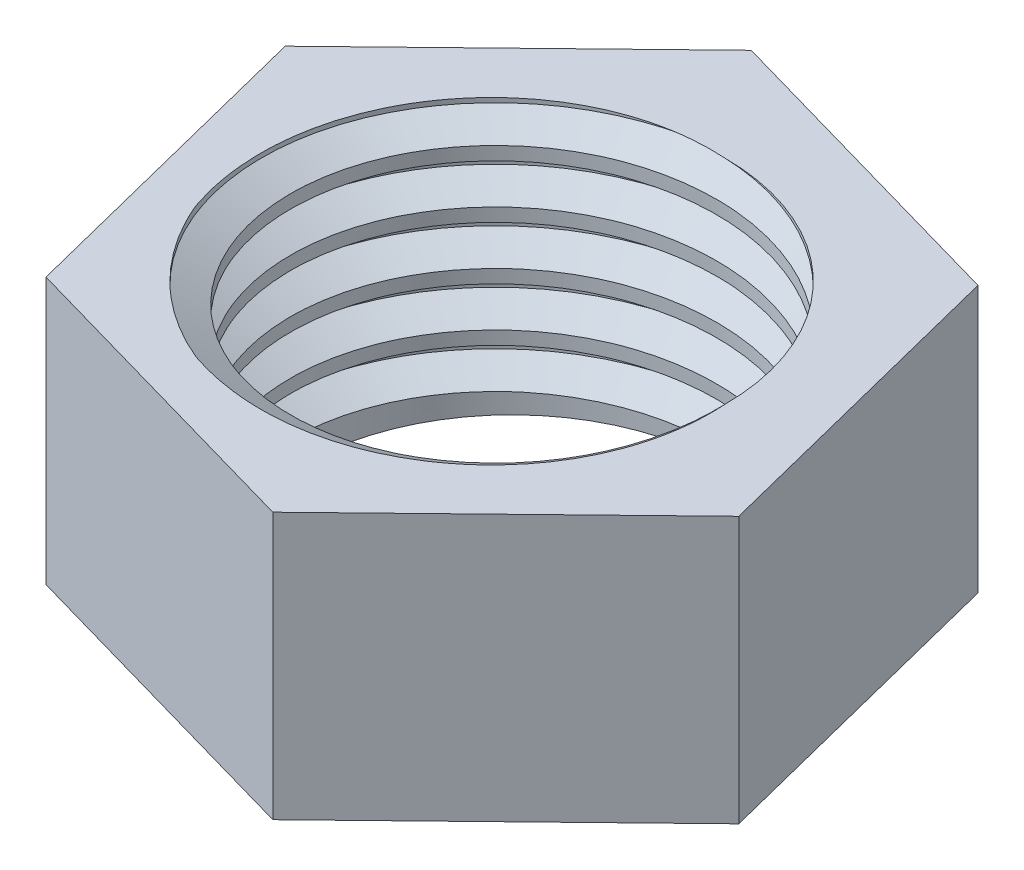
ISO-10303-21;
HEADER;
FILE_DESCRIPTION(('STEP AP214'),'2;1');
FILE_NAME('part.step','',(''),(''),'','','');
FILE_SCHEMA(('AUTOMOTIVE_DESIGN { 1 0 10303 214 1 1 1 1 }'));
ENDSEC;
DATA;
#1=APPLICATION_CONTEXT('core data for automotive mechanical design processes');
#2=APPLICATION_PROTOCOL_DEFINITION('international standard','automotive_design',2000,#1);
#3=PRODUCT_CONTEXT('',#1,'mechanical');
#4=PRODUCT('Part','Part','',(#3));
#5=PRODUCT_RELATED_PRODUCT_CATEGORY('part','',(#4));
#6=PRODUCT_DEFINITION_FORMATION('','',#4);
#7=PRODUCT_DEFINITION_CONTEXT('part definition',#1,'design');
#8=PRODUCT_DEFINITION('design','',#6,#7);
#9=PRODUCT_DEFINITION_SHAPE('','',#8);
#10=(LENGTH_UNIT() NAMED_UNIT(*) SI_UNIT(.MILLI.,.METRE.));
#11=(NAMED_UNIT(*) PLANE_ANGLE_UNIT() SI_UNIT($,.RADIAN.));
#12=(NAMED_UNIT(*) SI_UNIT($,.STERADIAN.) SOLID_ANGLE_UNIT());
#13=UNCERTAINTY_MEASURE_WITH_UNIT(LENGTH_MEASURE(1.E-05),#10,'distance_accuracy_value','');
#14=(GEOMETRIC_REPRESENTATION_CONTEXT(3) GLOBAL_UNCERTAINTY_ASSIGNED_CONTEXT((#13)) GLOBAL_UNIT_ASSIGNED_CONTEXT((#10,
#11,#12)) REPRESENTATION_CONTEXT('',''));
#15=CARTESIAN_POINT('',(0.,0.,0.));
#16=DIRECTION('',(0.,0.,1.));
#17=DIRECTION('',(1.,0.,0.));
#18=AXIS2_PLACEMENT_3D('',#15,#16,#17);
#19=CARTESIAN_POINT('',(0.,5.,0.));
#20=DIRECTION('',(0.,1.,0.));
#21=DIRECTION('',(0.,0.,1.));
#22=AXIS2_PLACEMENT_3D('',#19,#20,#21);
#23=PLANE('',#22);
#24=DIRECTION('',(0.717885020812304,0.,-0.696161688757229));
#25=VECTOR('',#24,1.);
#26=CARTESIAN_POINT('',(1.50930711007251,5.,6.));
#27=LINE('',#26,#25);
#28=CARTESIAN_POINT('',(1.50930711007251,5.,6.));
#29=VERTEX_POINT('',#28);
#30=CARTESIAN_POINT('',(5.95080597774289,5.,1.69290170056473));
#31=VERTEX_POINT('',#30);
#32=EDGE_CURVE('E147',#29,#31,#27,.T.);
#33=ORIENTED_EDGE('',*,*,#32,.T.);
#34=DIRECTION('',(-0.243951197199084,0.,-0.969787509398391));
#35=VECTOR('',#34,1.);
#36=CARTESIAN_POINT('',(5.95080597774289,5.,1.69290170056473));
#37=LINE('',#36,#35);
#38=CARTESIAN_POINT('',(4.44149886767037,5.,-4.30709829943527));
#39=VERTEX_POINT('',#38);
#40=EDGE_CURVE('E98',#31,#39,#37,.T.);
#41=ORIENTED_EDGE('',*,*,#40,.T.);
#42=DIRECTION('',(-0.961836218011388,0.,-0.273625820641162));
#43=VECTOR('',#42,1.);
#44=CARTESIAN_POINT('',(4.44149886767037,5.,-4.30709829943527));
#45=LINE('',#44,#43);
#46=CARTESIAN_POINT('',(-1.50930711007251,5.,-6.));
#47=VERTEX_POINT('',#46);
#48=EDGE_CURVE('E114',#39,#47,#45,.T.);
#49=ORIENTED_EDGE('',*,*,#48,.T.);
#50=DIRECTION('',(-0.717885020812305,0.,0.696161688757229));
#51=VECTOR('',#50,1.);
#52=CARTESIAN_POINT('',(-1.50930711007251,5.,-6.));
#53=LINE('',#52,#51);
#54=CARTESIAN_POINT('',(-5.95080597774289,5.,-1.69290170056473));
#55=VERTEX_POINT('',#54);
#56=EDGE_CURVE('E107',#47,#55,#53,.T.);
#57=ORIENTED_EDGE('',*,*,#56,.T.);
#58=DIRECTION('',(0.243951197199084,0.,0.969787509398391));
#59=VECTOR('',#58,1.);
#60=CARTESIAN_POINT('',(-5.95080597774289,5.,-1.69290170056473));
#61=LINE('',#60,#59);
#62=CARTESIAN_POINT('',(-4.44149886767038,5.,4.30709829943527));
#63=VERTEX_POINT('',#62);
#64=EDGE_CURVE('E111',#55,#63,#61,.T.);
#65=ORIENTED_EDGE('',*,*,#64,.T.);
#66=DIRECTION('',(0.961836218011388,0.,0.273625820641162));
#67=VECTOR('',#66,1.);
#68=CARTESIAN_POINT('',(-4.44149886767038,5.,4.30709829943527));
#69=LINE('',#68,#67);
#70=EDGE_CURVE('E62',#63,#29,#69,.T.);
#71=ORIENTED_EDGE('',*,*,#70,.T.);
#72=EDGE_LOOP('',(#33,#41,#49,#57,#65,#71));
#73=FACE_BOUND('',#72,.T.);
#74=CARTESIAN_POINT('',(0.,5.,0.));
#75=DIRECTION('',(0.,-1.,0.));
#76=DIRECTION('',(0.,0.,-1.));
#77=AXIS2_PLACEMENT_3D('',#74,#75,#76);
#78=CIRCLE('',#77,4.);
#79=CARTESIAN_POINT('',(-7.24028428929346E-08,5.,-4.));
#80=VERTEX_POINT('',#79);
#81=CARTESIAN_POINT('',(4.,5.,0.));
#82=VERTEX_POINT('',#81);
#83=EDGE_CURVE('E139',#80,#82,#78,.T.);
#84=ORIENTED_EDGE('',*,*,#83,.T.);
#85=CARTESIAN_POINT('',(4.,5.,0.));
#86=CARTESIAN_POINT('',(4.00736084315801,5.,0.112484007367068));
#87=CARTESIAN_POINT('',(4.01006200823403,5.,0.225271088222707));
#88=CARTESIAN_POINT('',(4.00617404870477,5.,0.450682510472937));
#89=CARTESIAN_POINT('',(3.99958514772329,5.,0.563306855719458));
#90=CARTESIAN_POINT('',(3.9771509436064,5.,0.787584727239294));
#91=CARTESIAN_POINT('',(3.9613093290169,5.,0.899238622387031));
#92=CARTESIAN_POINT('',(3.92048314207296,5.,1.12085914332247));
#93=CARTESIAN_POINT('',(3.89549879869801,5.,1.23082581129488));
#94=CARTESIAN_POINT('',(3.83654169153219,5.,1.44837877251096));
#95=CARTESIAN_POINT('',(3.80256467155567,5.,1.55596391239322));
#96=CARTESIAN_POINT('',(3.72585941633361,5.,1.76796787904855));
#97=CARTESIAN_POINT('',(3.68313116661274,5.,1.87238670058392));
#98=CARTESIAN_POINT('',(3.589237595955,5.,2.07730214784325));
#99=CARTESIAN_POINT('',(3.53807614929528,5.,2.17780054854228));
#100=CARTESIAN_POINT('',(3.42765289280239,5.,2.37423350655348));
#101=CARTESIAN_POINT('',(3.36839158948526,5.,2.47016834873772));
#102=CARTESIAN_POINT('',(3.24081904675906,5.,2.65886008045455));
#103=CARTESIAN_POINT('',(3.1723401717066,5.,2.75150378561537));
#104=CARTESIAN_POINT('',(3.02779689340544,5.,2.93067416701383));
#105=CARTESIAN_POINT('',(2.95173171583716,5.,3.01720021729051));
#106=CARTESIAN_POINT('',(2.79290031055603,5.,3.18398131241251));
#107=CARTESIAN_POINT('',(2.71012897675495,5.,3.26423148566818));
#108=CARTESIAN_POINT('',(2.53842953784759,5.,3.41784793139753));
#109=CARTESIAN_POINT('',(2.44950154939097,5.,3.4912143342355));
#110=CARTESIAN_POINT('',(2.26310346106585,5.,3.63284677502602));
#111=CARTESIAN_POINT('',(2.16545057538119,5.,3.70087274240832));
#112=CARTESIAN_POINT('',(1.96488645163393,5.,3.82862121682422));
#113=CARTESIAN_POINT('',(1.86197515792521,5.,3.88834363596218));
#114=CARTESIAN_POINT('',(1.54655869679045,5.,4.05433313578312));
#115=CARTESIAN_POINT('',(1.32707013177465,5.,4.14765052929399));
#116=CARTESIAN_POINT('',(0.871018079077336,5.,4.29841054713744));
#117=CARTESIAN_POINT('',(0.634197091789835,5.,4.35507997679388));
#118=CARTESIAN_POINT('',(0.334639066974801,5.,4.40060976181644));
#119=CARTESIAN_POINT('',(0.274454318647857,5.,4.40845952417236));
#120=CARTESIAN_POINT('',(0.153805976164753,5.,4.42161149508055));
#121=CARTESIAN_POINT('',(0.0933424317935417,5.,4.4269141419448));
#122=CARTESIAN_POINT('',(-0.0277574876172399,5.,4.43499442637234));
#123=CARTESIAN_POINT('',(-0.0883938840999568,5.,4.43777173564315));
#124=CARTESIAN_POINT('',(-0.209729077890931,5.,4.44091269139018));
#125=CARTESIAN_POINT('',(-0.270427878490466,5.,4.44127620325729));
#126=CARTESIAN_POINT('',(-0.450667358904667,5.,4.43872853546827));
#127=CARTESIAN_POINT('',(-0.570178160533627,5.,4.43229921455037));
#128=CARTESIAN_POINT('',(-0.808293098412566,5.,4.41001942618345));
#129=CARTESIAN_POINT('',(-0.926897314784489,5.,4.3941698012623));
#130=CARTESIAN_POINT('',(-1.1623150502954,5.,4.35316967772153));
#131=CARTESIAN_POINT('',(-1.2791308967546,5.,4.32803257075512));
#132=CARTESIAN_POINT('',(-1.51043328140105,5.,4.2686199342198));
#133=CARTESIAN_POINT('',(-1.62491947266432,5.,4.23434305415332));
#134=CARTESIAN_POINT('',(-1.73786717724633,5.,4.19558260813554));
#135=B_SPLINE_CURVE_WITH_KNOTS('',3,(#85,#86,#87,#88,#89,#90,#91,#92,#93,#94,#95,#96,#97,#98,
#99,#100,#101,#102,#103,#104,#105,#106,#107,#108,#109,#110,#111,#112,#113,#114,#115,#116,#117,
#118,#119,#120,#121,#122,#123,#124,#125,#126,#127,#128,#129,#130,#131,#132,#133,#134),
.UNSPECIFIED.,.F.,.F.,(4,2,2,2,2,2,2,2,2,2,2,2,2,2,2,2,2,2,2,2,2,2,2,2,4),(0.,0.338075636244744,
0.676143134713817,1.01407595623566,1.35200031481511,1.69008489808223,2.02817004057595,
2.3661002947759,2.70400942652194,3.04920729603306,3.394440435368,3.73993895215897,
4.08543092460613,4.44203963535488,4.79865212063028,5.51075854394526,6.23743705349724,
6.41949427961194,6.6015201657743,6.78356971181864,6.96562941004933,7.32427156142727,
7.6828816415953,8.04097664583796,8.39912459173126),.UNSPECIFIED.);
#136=CARTESIAN_POINT('',(-1.73786717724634,5.,4.19558260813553));
#137=VERTEX_POINT('',#136);
#138=EDGE_CURVE('E169',#82,#137,#135,.T.);
#139=ORIENTED_EDGE('',*,*,#138,.T.);
#140=CARTESIAN_POINT('',(-1.73786717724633,5.,4.19558260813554));
#141=CARTESIAN_POINT('',(-1.81488246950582,5.,4.163689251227));
#142=CARTESIAN_POINT('',(-1.89103345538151,5.,4.12965748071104));
#143=CARTESIAN_POINT('',(-2.11761144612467,5.,4.02081766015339));
#144=CARTESIAN_POINT('',(-2.26503386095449,5.,3.9396616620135));
#145=CARTESIAN_POINT('',(-2.55003137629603,5.,3.76147655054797));
#146=CARTESIAN_POINT('',(-2.68760206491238,5.,3.66444038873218));
#147=CARTESIAN_POINT('',(-2.9180204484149,5.,3.48196809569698));
#148=CARTESIAN_POINT('',(-3.0134245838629,5.,3.39973668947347));
#149=CARTESIAN_POINT('',(-3.19707239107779,5.,3.22763913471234));
#150=CARTESIAN_POINT('',(-3.28531682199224,5.,3.13777379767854));
#151=CARTESIAN_POINT('',(-3.45622955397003,5.,2.94860001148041));
#152=CARTESIAN_POINT('',(-3.53869352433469,5.,2.84910693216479));
#153=CARTESIAN_POINT('',(-3.69484381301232,5.,2.64346264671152));
#154=CARTESIAN_POINT('',(-3.76853049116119,5.,2.53731171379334));
#155=CARTESIAN_POINT('',(-3.90694335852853,5.,2.31855942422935));
#156=CARTESIAN_POINT('',(-3.97162186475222,5.,2.20592789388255));
#157=CARTESIAN_POINT('',(-4.09111697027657,5.,1.97553422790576));
#158=CARTESIAN_POINT('',(-4.14593248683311,5.,1.85777153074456));
#159=CARTESIAN_POINT('',(-4.1955825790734,5.,1.73786724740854));
#160=B_SPLINE_CURVE_WITH_KNOTS('',3,(#140,#141,#142,#143,#144,#145,#146,#147,#148,#149,#150,
#151,#152,#153,#154,#155,#156,#157,#158,#159),.UNSPECIFIED.,.F.,.F.,(4,2,2,2,2,2,2,2,2,4),(0.,
0.250094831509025,0.753855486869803,1.25784034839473,1.63528485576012,2.01268929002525,
2.39989502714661,2.78708488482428,3.17625211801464,3.56546204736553),.UNSPECIFIED.);
#161=CARTESIAN_POINT('',(-4.19558257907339,5.,1.73786724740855));
#162=VERTEX_POINT('',#161);
#163=EDGE_CURVE('E11',#137,#162,#160,.T.);
#164=ORIENTED_EDGE('',*,*,#163,.T.);
#165=CARTESIAN_POINT('',(-4.1955825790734,5.,1.73786724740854));
#166=CARTESIAN_POINT('',(-4.23202034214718,5.,1.63168171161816));
#167=CARTESIAN_POINT('',(-4.26449736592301,5.,1.52413882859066));
#168=CARTESIAN_POINT('',(-4.32138133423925,5.,1.30695674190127));
#169=CARTESIAN_POINT('',(-4.34578949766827,5.,1.19731785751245));
#170=CARTESIAN_POINT('',(-4.38642050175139,5.,0.976408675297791));
#171=CARTESIAN_POINT('',(-4.40263434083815,5.,0.865136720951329));
#172=CARTESIAN_POINT('',(-4.4267533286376,5.,0.641689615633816));
#173=CARTESIAN_POINT('',(-4.43465780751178,5.,0.529514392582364));
#174=CARTESIAN_POINT('',(-4.44210696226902,5.,0.304811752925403));
#175=CARTESIAN_POINT('',(-4.44164682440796,5.,0.19228417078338));
#176=CARTESIAN_POINT('',(-4.43470406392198,5.,0.0237792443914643));
#177=CARTESIAN_POINT('',(-4.43134763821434,5.,-0.032342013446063));
#178=CARTESIAN_POINT('',(-4.42243724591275,5.,-0.144417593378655));
#179=CARTESIAN_POINT('',(-4.41688299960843,5.,-0.20037189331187));
#180=CARTESIAN_POINT('',(-4.39696026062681,5.,-0.367767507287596));
#181=CARTESIAN_POINT('',(-4.37932784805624,5.,-0.478838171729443));
#182=CARTESIAN_POINT('',(-4.3354508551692,5.,-0.699274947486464));
#183=CARTESIAN_POINT('',(-4.30920442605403,5.,-0.808640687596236));
#184=CARTESIAN_POINT('',(-4.24530451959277,5.,-1.03547708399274));
#185=CARTESIAN_POINT('',(-4.2067926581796,5.,-1.15270727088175));
#186=CARTESIAN_POINT('',(-4.11988019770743,5.,-1.38343268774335));
#187=CARTESIAN_POINT('',(-4.07148003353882,5.,-1.49692808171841));
#188=CARTESIAN_POINT('',(-3.96508782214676,5.,-1.7194773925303));
#189=CARTESIAN_POINT('',(-3.90708577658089,5.,-1.8285265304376));
#190=CARTESIAN_POINT('',(-3.78195269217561,5.,-2.04125132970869));
#191=CARTESIAN_POINT('',(-3.71482197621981,5.,-2.14492718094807));
#192=CARTESIAN_POINT('',(-3.57306136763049,5.,-2.344548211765));
#193=CARTESIAN_POINT('',(-3.49856710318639,5.,-2.44058983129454));
#194=CARTESIAN_POINT('',(-3.34176263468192,5.,-2.62603071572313));
#195=CARTESIAN_POINT('',(-3.25945514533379,5.,-2.71543226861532));
#196=CARTESIAN_POINT('',(-3.13060629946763,5.,-2.84405206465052));
#197=CARTESIAN_POINT('',(-3.08676449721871,5.,-2.88600673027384));
#198=CARTESIAN_POINT('',(-2.99736552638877,5.,-2.9680284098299));
#199=CARTESIAN_POINT('',(-2.9518087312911,5.,-3.0080958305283));
#200=CARTESIAN_POINT('',(-2.8125324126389,5.,-3.12519161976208));
#201=CARTESIAN_POINT('',(-2.71618534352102,5.,-3.19913524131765));
#202=CARTESIAN_POINT('',(-2.51877175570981,5.,-3.33719023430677));
#203=CARTESIAN_POINT('',(-2.41779309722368,5.,-3.40142777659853));
#204=CARTESIAN_POINT('',(-2.21059350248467,5.,-3.52084136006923));
#205=CARTESIAN_POINT('',(-2.10437207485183,5.,-3.57601654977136));
#206=CARTESIAN_POINT('',(-1.88747809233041,5.,-3.67688916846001));
#207=CARTESIAN_POINT('',(-1.77680401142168,5.,-3.7225833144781));
#208=CARTESIAN_POINT('',(-1.55188460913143,5.,-3.80411803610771));
#209=CARTESIAN_POINT('',(-1.43763939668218,5.,-3.83995891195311));
#210=CARTESIAN_POINT('',(-1.21460584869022,5.,-3.8993429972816));
#211=CARTESIAN_POINT('',(-1.10600017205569,5.,-3.92357474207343));
#212=CARTESIAN_POINT('',(-0.887180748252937,5.,-3.96312975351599));
#213=CARTESIAN_POINT('',(-0.776967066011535,5.,-3.97845337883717));
#214=CARTESIAN_POINT('',(-0.555656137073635,5.,-4.00008944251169));
#215=CARTESIAN_POINT('',(-0.444558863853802,5.,-4.00640160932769));
#216=CARTESIAN_POINT('',(-0.222209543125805,5.,-4.00998746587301));
#217=CARTESIAN_POINT('',(-0.11095748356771,5.,-4.00726040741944));
#218=CARTESIAN_POINT('',(-7.24028428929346E-08,5.,-4.));
#219=B_SPLINE_CURVE_WITH_KNOTS('',3,(#165,#166,#167,#168,#169,#170,#171,#172,#173,#174,#175,
#176,#177,#178,#179,#180,#181,#182,#183,#184,#185,#186,#187,#188,#189,#190,#191,#192,#193,#194,
#195,#196,#197,#198,#199,#200,#201,#202,#203,#204,#205,#206,#207,#208,#209,#210,#211,#212,#213,
#214,#215,#216,#217,#218),.UNSPECIFIED.,.F.,.F.,(4,2,2,2,2,2,2,2,2,2,2,2,2,2,2,2,2,2,2,2,2,2,2,
2,2,2,4),(0.,0.336710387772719,0.673369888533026,1.01039841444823,1.34745410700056,
1.68470377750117,1.85333277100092,2.02198323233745,2.35899480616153,2.69607875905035,
3.0657986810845,3.43550234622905,3.80559342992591,4.17567142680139,4.53988747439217,
4.90397743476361,5.08597745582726,5.26793806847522,5.63176768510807,5.99036196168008,
6.34898991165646,6.70774183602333,7.06648282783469,7.39994803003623,7.73339980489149,
8.06686162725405,8.4003510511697),.UNSPECIFIED.);
#220=EDGE_CURVE('E179',#162,#80,#219,.T.);
#221=ORIENTED_EDGE('',*,*,#220,.T.);
#222=EDGE_LOOP('',(#84,#139,#164,#221));
#223=FACE_BOUND('',#222,.T.);
#224=ADVANCED_FACE('F32',(#73,#223),#23,.T.);
#225=CARTESIAN_POINT('',(0.,5.,0.));
#226=DIRECTION('',(0.,-1.,0.));
#227=DIRECTION('',(0.,0.,-1.));
#228=AXIS2_PLACEMENT_3D('',#225,#226,#227);
#229=CYLINDRICAL_SURFACE('',#228,4.);
#230=CARTESIAN_POINT('',(4.,0.,0.));
#231=CARTESIAN_POINT('',(4.,0.0625,-1.65685424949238));
#232=CARTESIAN_POINT('',(2.82842712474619,0.125,-2.82842712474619));
#233=CARTESIAN_POINT('',(1.65685424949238,0.1875,-4.));
#234=CARTESIAN_POINT('',(0.,0.25,-4.));
#235=CARTESIAN_POINT('',(-1.65685424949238,0.3125,-4.));
#236=CARTESIAN_POINT('',(-2.82842712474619,0.375,-2.82842712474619));
#237=CARTESIAN_POINT('',(-4.,0.4375,-1.65685424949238));
#238=CARTESIAN_POINT('',(-4.,0.5,0.));
#239=CARTESIAN_POINT('',(-4.,0.5625,1.65685424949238));
#240=CARTESIAN_POINT('',(-2.82842712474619,0.625,2.82842712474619));
#241=CARTESIAN_POINT('',(-1.65685424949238,0.6875,4.));
#242=CARTESIAN_POINT('',(0.,0.75,4.));
#243=CARTESIAN_POINT('',(1.65685424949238,0.8125,4.));
#244=CARTESIAN_POINT('',(2.82842712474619,0.875,2.82842712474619));
#245=CARTESIAN_POINT('',(4.,0.9375,1.65685424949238));
#246=CARTESIAN_POINT('',(4.,1.,0.));
#247=CARTESIAN_POINT('',(4.,1.0625,-1.65685424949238));
#248=CARTESIAN_POINT('',(2.82842712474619,1.125,-2.82842712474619));
#249=CARTESIAN_POINT('',(1.65685424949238,1.1875,-4.));
#250=CARTESIAN_POINT('',(0.,1.25,-4.));
#251=CARTESIAN_POINT('',(-1.65685424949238,1.3125,-4.));
#252=CARTESIAN_POINT('',(-2.82842712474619,1.375,-2.82842712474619));
#253=CARTESIAN_POINT('',(-4.,1.4375,-1.65685424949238));
#254=CARTESIAN_POINT('',(-4.,1.5,0.));
#255=CARTESIAN_POINT('',(-4.,1.5625,1.65685424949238));
#256=CARTESIAN_POINT('',(-2.82842712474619,1.625,2.82842712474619));
#257=CARTESIAN_POINT('',(-1.65685424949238,1.6875,4.));
#258=CARTESIAN_POINT('',(0.,1.75,4.));
#259=CARTESIAN_POINT('',(1.65685424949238,1.8125,4.));
#260=CARTESIAN_POINT('',(2.82842712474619,1.875,2.82842712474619));
#261=CARTESIAN_POINT('',(4.,1.9375,1.65685424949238));
#262=CARTESIAN_POINT('',(4.,2.,0.));
#263=CARTESIAN_POINT('',(4.,2.0625,-1.65685424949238));
#264=CARTESIAN_POINT('',(2.82842712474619,2.125,-2.82842712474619));
#265=CARTESIAN_POINT('',(1.65685424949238,2.1875,-4.));
#266=CARTESIAN_POINT('',(0.,2.25,-4.));
#267=CARTESIAN_POINT('',(-1.65685424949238,2.3125,-4.));
#268=CARTESIAN_POINT('',(-2.82842712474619,2.375,-2.82842712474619));
#269=CARTESIAN_POINT('',(-4.,2.4375,-1.65685424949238));
#270=CARTESIAN_POINT('',(-4.,2.5,0.));
#271=CARTESIAN_POINT('',(-4.,2.5625,1.65685424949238));
#272=CARTESIAN_POINT('',(-2.82842712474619,2.625,2.82842712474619));
#273=CARTESIAN_POINT('',(-1.65685424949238,2.6875,4.));
#274=CARTESIAN_POINT('',(0.,2.75,4.));
#275=CARTESIAN_POINT('',(1.65685424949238,2.8125,4.));
#276=CARTESIAN_POINT('',(2.82842712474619,2.875,2.82842712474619));
#277=CARTESIAN_POINT('',(4.,2.9375,1.65685424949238));
#278=CARTESIAN_POINT('',(4.,3.,0.));
#279=CARTESIAN_POINT('',(4.,3.0625,-1.65685424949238));
#280=CARTESIAN_POINT('',(2.82842712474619,3.125,-2.82842712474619));
#281=CARTESIAN_POINT('',(1.65685424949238,3.1875,-4.));
#282=CARTESIAN_POINT('',(0.,3.25,-4.));
#283=CARTESIAN_POINT('',(-1.65685424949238,3.3125,-4.));
#284=CARTESIAN_POINT('',(-2.82842712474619,3.375,-2.82842712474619));
#285=CARTESIAN_POINT('',(-4.,3.4375,-1.65685424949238));
#286=CARTESIAN_POINT('',(-4.,3.5,0.));
#287=CARTESIAN_POINT('',(-4.,3.5625,1.65685424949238));
#288=CARTESIAN_POINT('',(-2.82842712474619,3.625,2.82842712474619));
#289=CARTESIAN_POINT('',(-1.65685424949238,3.6875,4.));
#290=CARTESIAN_POINT('',(0.,3.75,4.));
#291=CARTESIAN_POINT('',(1.65685424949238,3.8125,4.));
#292=CARTESIAN_POINT('',(2.82842712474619,3.875,2.82842712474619));
#293=CARTESIAN_POINT('',(4.,3.9375,1.65685424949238));
#294=CARTESIAN_POINT('',(4.,4.,0.));
#295=CARTESIAN_POINT('',(4.,4.0625,-1.65685424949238));
#296=CARTESIAN_POINT('',(2.82842712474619,4.125,-2.82842712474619));
#297=CARTESIAN_POINT('',(1.65685424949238,4.1875,-4.));
#298=CARTESIAN_POINT('',(0.,4.25,-4.));
#299=CARTESIAN_POINT('',(-1.65685424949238,4.3125,-4.));
#300=CARTESIAN_POINT('',(-2.82842712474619,4.375,-2.82842712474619));
#301=CARTESIAN_POINT('',(-4.,4.4375,-1.65685424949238));
#302=CARTESIAN_POINT('',(-4.,4.5,0.));
#303=CARTESIAN_POINT('',(-4.,4.5625,1.65685424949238));
#304=CARTESIAN_POINT('',(-2.82842712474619,4.625,2.82842712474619));
#305=CARTESIAN_POINT('',(-1.65685424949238,4.6875,4.));
#306=CARTESIAN_POINT('',(0.,4.75,4.));
#307=CARTESIAN_POINT('',(1.65685424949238,4.8125,4.));
#308=CARTESIAN_POINT('',(2.82842712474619,4.875,2.82842712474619));
#309=CARTESIAN_POINT('',(4.,4.9375,1.65685424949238));
#310=CARTESIAN_POINT('',(4.,5.,0.));
#311=(BOUNDED_CURVE() B_SPLINE_CURVE(2,(#230,#231,#232,#233,#234,#235,#236,#237,#238,#239,#240,
#241,#242,#243,#244,#245,#246,#247,#248,#249,#250,#251,#252,#253,#254,#255,#256,#257,#258,#259,
#260,#261,#262,#263,#264,#265,#266,#267,#268,#269,#270,#271,#272,#273,#274,#275,#276,#277,#278,
#279,#280,#281,#282,#283,#284,#285,#286,#287,#288,#289,#290,#291,#292,#293,#294,#295,#296,#297,
#298,#299,#300,#301,#302,#303,#304,#305,#306,#307,#308,#309,#310),.UNSPECIFIED.,.F.,
.F.) B_SPLINE_CURVE_WITH_KNOTS((3,2,2,2,2,2,2,2,2,2,2,2,2,2,2,2,2,2,2,2,2,2,2,2,2,2,2,2,2,2,2,2,
2,2,2,2,2,2,2,2,3),(0.,0.025,0.05,0.075,0.1,0.125,0.15,0.175,0.2,0.225,0.25,0.275,0.3,0.325,
0.35,0.375,0.4,0.425,0.45,0.475,0.5,0.525,0.55,0.575,0.6,0.625,0.65,0.675,0.7,0.725,0.75,0.775,
0.8,0.825,0.85,0.875,0.9,0.925,0.95,0.975,1.),
.UNSPECIFIED.) CURVE() GEOMETRIC_REPRESENTATION_ITEM() RATIONAL_B_SPLINE_CURVE((1.,
0.923879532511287,1.,0.923879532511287,1.,0.923879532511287,1.,0.923879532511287,1.,
0.923879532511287,1.,0.923879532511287,1.,0.923879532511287,1.,0.923879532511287,1.,
0.923879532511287,1.,0.923879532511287,1.,0.923879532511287,1.,0.923879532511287,1.,
0.923879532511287,1.,0.923879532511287,1.,0.923879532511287,1.,0.923879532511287,1.,
0.923879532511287,1.,0.923879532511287,1.,0.923879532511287,1.,0.923879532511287,1.,
0.923879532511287,1.,0.923879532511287,1.,0.923879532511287,1.,0.923879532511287,1.,
0.923879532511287,1.,0.923879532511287,1.,0.923879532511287,1.,0.923879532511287,1.,
0.923879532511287,1.,0.923879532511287,1.,0.923879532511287,1.,0.923879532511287,1.,
0.923879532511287,1.,0.923879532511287,1.,0.923879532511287,1.,0.923879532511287,1.,
0.923879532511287,1.,0.923879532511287,1.,0.923879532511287,1.,0.923879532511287,1.)) REPRESENTATION_ITEM(''));
#312=CARTESIAN_POINT('',(4.,0.,0.));
#313=VERTEX_POINT('',#312);
#314=EDGE_CURVE('E231',#313,#82,#311,.T.);
#315=ORIENTED_EDGE('',*,*,#314,.T.);
#316=ORIENTED_EDGE('',*,*,#83,.F.);
#317=CARTESIAN_POINT('',(4.,0.749999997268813,0.));
#318=CARTESIAN_POINT('',(4.,0.812499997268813,-1.65685424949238));
#319=CARTESIAN_POINT('',(2.82842712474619,0.874999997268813,-2.82842712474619));
#320=CARTESIAN_POINT('',(1.65685424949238,0.937499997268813,-4.));
#321=CARTESIAN_POINT('',(0.,0.999999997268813,-4.));
#322=CARTESIAN_POINT('',(-1.65685424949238,1.06249999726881,-4.));
#323=CARTESIAN_POINT('',(-2.82842712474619,1.12499999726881,-2.82842712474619));
#324=CARTESIAN_POINT('',(-4.,1.18749999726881,-1.65685424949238));
#325=CARTESIAN_POINT('',(-4.,1.24999999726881,0.));
#326=CARTESIAN_POINT('',(-4.,1.31249999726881,1.65685424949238));
#327=CARTESIAN_POINT('',(-2.82842712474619,1.37499999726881,2.82842712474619));
#328=CARTESIAN_POINT('',(-1.65685424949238,1.43749999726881,4.));
#329=CARTESIAN_POINT('',(0.,1.49999999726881,4.));
#330=CARTESIAN_POINT('',(1.65685424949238,1.56249999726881,4.));
#331=CARTESIAN_POINT('',(2.82842712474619,1.62499999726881,2.82842712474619));
#332=CARTESIAN_POINT('',(4.,1.68749999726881,1.65685424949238));
#333=CARTESIAN_POINT('',(4.,1.74999999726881,0.));
#334=CARTESIAN_POINT('',(4.,1.81249999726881,-1.65685424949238));
#335=CARTESIAN_POINT('',(2.82842712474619,1.87499999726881,-2.82842712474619));
#336=CARTESIAN_POINT('',(1.65685424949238,1.93749999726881,-4.));
#337=CARTESIAN_POINT('',(0.,1.99999999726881,-4.));
#338=CARTESIAN_POINT('',(-1.65685424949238,2.06249999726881,-4.));
#339=CARTESIAN_POINT('',(-2.82842712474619,2.12499999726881,-2.82842712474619));
#340=CARTESIAN_POINT('',(-4.,2.18749999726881,-1.65685424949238));
#341=CARTESIAN_POINT('',(-4.,2.24999999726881,0.));
#342=CARTESIAN_POINT('',(-4.,2.31249999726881,1.65685424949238));
#343=CARTESIAN_POINT('',(-2.82842712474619,2.37499999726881,2.82842712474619));
#344=CARTESIAN_POINT('',(-1.65685424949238,2.43749999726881,4.));
#345=CARTESIAN_POINT('',(0.,2.49999999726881,4.));
#346=CARTESIAN_POINT('',(1.65685424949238,2.56249999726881,4.));
#347=CARTESIAN_POINT('',(2.82842712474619,2.62499999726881,2.82842712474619));
#348=CARTESIAN_POINT('',(4.,2.68749999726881,1.65685424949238));
#349=CARTESIAN_POINT('',(4.,2.74999999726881,0.));
#350=CARTESIAN_POINT('',(4.,2.81249999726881,-1.65685424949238));
#351=CARTESIAN_POINT('',(2.82842712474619,2.87499999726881,-2.82842712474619));
#352=CARTESIAN_POINT('',(1.65685424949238,2.93749999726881,-4.));
#353=CARTESIAN_POINT('',(0.,2.99999999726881,-4.));
#354=CARTESIAN_POINT('',(-1.65685424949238,3.06249999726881,-4.));
#355=CARTESIAN_POINT('',(-2.82842712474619,3.12499999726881,-2.82842712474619));
#356=CARTESIAN_POINT('',(-4.,3.18749999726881,-1.65685424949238));
#357=CARTESIAN_POINT('',(-4.,3.24999999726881,0.));
#358=CARTESIAN_POINT('',(-4.,3.31249999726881,1.65685424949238));
#359=CARTESIAN_POINT('',(-2.82842712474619,3.37499999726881,2.82842712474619));
#360=CARTESIAN_POINT('',(-1.65685424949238,3.43749999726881,4.));
#361=CARTESIAN_POINT('',(0.,3.49999999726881,4.));
#362=CARTESIAN_POINT('',(1.65685424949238,3.56249999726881,4.));
#363=CARTESIAN_POINT('',(2.82842712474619,3.62499999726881,2.82842712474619));
#364=CARTESIAN_POINT('',(4.,3.68749999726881,1.65685424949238));
#365=CARTESIAN_POINT('',(4.,3.74999999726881,0.));
#366=CARTESIAN_POINT('',(4.,3.81249999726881,-1.65685424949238));
#367=CARTESIAN_POINT('',(2.82842712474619,3.87499999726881,-2.82842712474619));
#368=CARTESIAN_POINT('',(1.65685424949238,3.93749999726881,-4.));
#369=CARTESIAN_POINT('',(0.,3.99999999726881,-4.));
#370=CARTESIAN_POINT('',(-1.65685424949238,4.06249999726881,-4.));
#371=CARTESIAN_POINT('',(-2.82842712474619,4.12499999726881,-2.82842712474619));
#372=CARTESIAN_POINT('',(-4.,4.18749999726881,-1.65685424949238));
#373=CARTESIAN_POINT('',(-4.,4.24999999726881,0.));
#374=CARTESIAN_POINT('',(-4.,4.31249999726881,1.65685424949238));
#375=CARTESIAN_POINT('',(-2.82842712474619,4.37499999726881,2.82842712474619));
#376=CARTESIAN_POINT('',(-1.65685424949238,4.43749999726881,4.));
#377=CARTESIAN_POINT('',(0.,4.49999999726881,4.));
#378=CARTESIAN_POINT('',(1.65685424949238,4.56249999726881,4.));
#379=CARTESIAN_POINT('',(2.82842712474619,4.62499999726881,2.82842712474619));
#380=CARTESIAN_POINT('',(4.,4.68749999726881,1.65685424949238));
#381=CARTESIAN_POINT('',(4.,4.74999999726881,0.));
#382=CARTESIAN_POINT('',(4.,4.81249999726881,-1.65685424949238));
#383=CARTESIAN_POINT('',(2.82842712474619,4.87499999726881,-2.82842712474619));
#384=CARTESIAN_POINT('',(1.65685424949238,4.93749999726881,-4.));
#385=CARTESIAN_POINT('',(0.,4.99999999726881,-4.));
#386=CARTESIAN_POINT('',(-1.65685424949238,5.06249999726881,-4.));
#387=CARTESIAN_POINT('',(-2.82842712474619,5.12499999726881,-2.82842712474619));
#388=CARTESIAN_POINT('',(-4.,5.18749999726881,-1.65685424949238));
#389=CARTESIAN_POINT('',(-4.,5.24999999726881,0.));
#390=CARTESIAN_POINT('',(-4.,5.31249999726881,1.65685424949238));
#391=CARTESIAN_POINT('',(-2.82842712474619,5.37499999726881,2.82842712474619));
#392=CARTESIAN_POINT('',(-1.65685424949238,5.43749999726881,4.));
#393=CARTESIAN_POINT('',(0.,5.49999999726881,4.));
#394=CARTESIAN_POINT('',(1.65685424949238,5.56249999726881,4.));
#395=CARTESIAN_POINT('',(2.82842712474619,5.62499999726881,2.82842712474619));
#396=CARTESIAN_POINT('',(4.,5.68749999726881,1.65685424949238));
#397=CARTESIAN_POINT('',(4.,5.74999999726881,0.));
#398=(BOUNDED_CURVE() B_SPLINE_CURVE(2,(#317,#318,#319,#320,#321,#322,#323,#324,#325,#326,#327,
#328,#329,#330,#331,#332,#333,#334,#335,#336,#337,#338,#339,#340,#341,#342,#343,#344,#345,#346,
#347,#348,#349,#350,#351,#352,#353,#354,#355,#356,#357,#358,#359,#360,#361,#362,#363,#364,#365,
#366,#367,#368,#369,#370,#371,#372,#373,#374,#375,#376,#377,#378,#379,#380,#381,#382,#383,#384,
#385,#386,#387,#388,#389,#390,#391,#392,#393,#394,#395,#396,#397),.UNSPECIFIED.,.F.,
.F.) B_SPLINE_CURVE_WITH_KNOTS((3,2,2,2,2,2,2,2,2,2,2,2,2,2,2,2,2,2,2,2,2,2,2,2,2,2,2,2,2,2,2,2,
2,2,2,2,2,2,2,2,3),(0.,0.025,0.05,0.075,0.1,0.125,0.15,0.175,0.2,0.225,0.25,0.275,0.3,0.325,
0.35,0.375,0.4,0.425,0.45,0.475,0.5,0.525,0.55,0.575,0.6,0.625,0.65,0.675,0.7,0.725,0.75,0.775,
0.8,0.825,0.85,0.875,0.9,0.925,0.95,0.975,1.),
.UNSPECIFIED.) CURVE() GEOMETRIC_REPRESENTATION_ITEM() RATIONAL_B_SPLINE_CURVE((1.,
0.923879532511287,1.,0.923879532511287,1.,0.923879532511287,1.,0.923879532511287,1.,
0.923879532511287,1.,0.923879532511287,1.,0.923879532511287,1.,0.923879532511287,1.,
0.923879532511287,1.,0.923879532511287,1.,0.923879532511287,1.,0.923879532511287,1.,
0.923879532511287,1.,0.923879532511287,1.,0.923879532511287,1.,0.923879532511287,1.,
0.923879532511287,1.,0.923879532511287,1.,0.923879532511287,1.,0.923879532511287,1.,
0.923879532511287,1.,0.923879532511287,1.,0.923879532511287,1.,0.923879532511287,1.,
0.923879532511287,1.,0.923879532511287,1.,0.923879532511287,1.,0.923879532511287,1.,
0.923879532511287,1.,0.923879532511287,1.,0.923879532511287,1.,0.923879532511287,1.,
0.923879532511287,1.,0.923879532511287,1.,0.923879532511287,1.,0.923879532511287,1.,
0.923879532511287,1.,0.923879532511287,1.,0.923879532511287,1.,0.923879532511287,1.)) REPRESENTATION_ITEM(''));
#399=CARTESIAN_POINT('',(4.,0.749999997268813,0.));
#400=VERTEX_POINT('',#399);
#401=EDGE_CURVE('E265',#400,#80,#398,.T.);
#402=ORIENTED_EDGE('',*,*,#401,.F.);
#403=DIRECTION('',(0.,-1.,0.));
#404=VECTOR('',#403,1.);
#405=CARTESIAN_POINT('',(4.,0.374999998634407,0.));
#406=LINE('',#405,#404);
#407=EDGE_CURVE('E53',#400,#313,#406,.T.);
#408=ORIENTED_EDGE('',*,*,#407,.T.);
#409=CARTESIAN_POINT('',(0.,0.,0.));
#410=DIRECTION('',(0.,-1.,0.));
#411=DIRECTION('',(0.,0.,-1.));
#412=AXIS2_PLACEMENT_3D('',#409,#410,#411);
#413=CIRCLE('',#412,4.);
#414=EDGE_CURVE('E166',#313,#313,#413,.T.);
#415=ORIENTED_EDGE('',*,*,#414,.T.);
#416=EDGE_LOOP('',(#315,#316,#402,#408,#415));
#417=FACE_BOUND('',#416,.T.);
#418=ADVANCED_FACE('F220',(#417),#229,.F.);
#419=CARTESIAN_POINT('',(1.50930711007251,5.,6.));
#420=DIRECTION('',(-0.696161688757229,0.,-0.717885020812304));
#421=DIRECTION('',(-0.717885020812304,0.,0.696161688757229));
#422=AXIS2_PLACEMENT_3D('',#419,#420,#421);
#423=PLANE('',#422);
#424=DIRECTION('',(0.717885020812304,0.,-0.696161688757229));
#425=VECTOR('',#424,1.);
#426=CARTESIAN_POINT('',(1.50930711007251,0.,6.));
#427=LINE('',#426,#425);
#428=CARTESIAN_POINT('',(1.50930711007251,0.,6.));
#429=VERTEX_POINT('',#428);
#430=CARTESIAN_POINT('',(5.95080597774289,0.,1.69290170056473));
#431=VERTEX_POINT('',#430);
#432=EDGE_CURVE('E135',#429,#431,#427,.T.);
#433=ORIENTED_EDGE('',*,*,#432,.T.);
#434=DIRECTION('',(0.,-1.,0.));
#435=VECTOR('',#434,1.);
#436=CARTESIAN_POINT('',(5.95080597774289,5.,1.69290170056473));
#437=LINE('',#436,#435);
#438=EDGE_CURVE('E46',#31,#431,#437,.T.);
#439=ORIENTED_EDGE('',*,*,#438,.F.);
#440=ORIENTED_EDGE('',*,*,#32,.F.);
#441=DIRECTION('',(0.,-1.,0.));
#442=VECTOR('',#441,1.);
#443=CARTESIAN_POINT('',(1.50930711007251,5.,6.));
#444=LINE('',#443,#442);
#445=EDGE_CURVE('E131',#29,#429,#444,.T.);
#446=ORIENTED_EDGE('',*,*,#445,.T.);
#447=EDGE_LOOP('',(#433,#439,#440,#446));
#448=FACE_BOUND('',#447,.T.);
#449=ADVANCED_FACE('F34',(#448),#423,.F.);
#450=CARTESIAN_POINT('',(5.95080597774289,5.,1.69290170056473));
#451=DIRECTION('',(-0.969787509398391,0.,0.243951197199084));
#452=DIRECTION('',(0.243951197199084,0.,0.969787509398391));
#453=AXIS2_PLACEMENT_3D('',#450,#451,#452);
#454=PLANE('',#453);
#455=DIRECTION('',(-0.243951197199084,0.,-0.969787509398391));
#456=VECTOR('',#455,1.);
#457=CARTESIAN_POINT('',(5.95080597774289,0.,1.69290170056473));
#458=LINE('',#457,#456);
#459=CARTESIAN_POINT('',(4.44149886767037,0.,-4.30709829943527));
#460=VERTEX_POINT('',#459);
#461=EDGE_CURVE('E138',#431,#460,#458,.T.);
#462=ORIENTED_EDGE('',*,*,#461,.T.);
#463=DIRECTION('',(0.,-1.,0.));
#464=VECTOR('',#463,1.);
#465=CARTESIAN_POINT('',(4.44149886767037,5.,-4.30709829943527));
#466=LINE('',#465,#464);
#467=EDGE_CURVE('E151',#39,#460,#466,.T.);
#468=ORIENTED_EDGE('',*,*,#467,.F.);
#469=ORIENTED_EDGE('',*,*,#40,.F.);
#470=ORIENTED_EDGE('',*,*,#438,.T.);
#471=EDGE_LOOP('',(#462,#468,#469,#470));
#472=FACE_BOUND('',#471,.T.);
#473=ADVANCED_FACE('F154',(#472),#454,.F.);
#474=CARTESIAN_POINT('',(4.44149886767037,5.,-4.30709829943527));
#475=DIRECTION('',(-0.273625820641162,0.,0.961836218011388));
#476=DIRECTION('',(0.961836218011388,0.,0.273625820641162));
#477=AXIS2_PLACEMENT_3D('',#474,#475,#476);
#478=PLANE('',#477);
#479=DIRECTION('',(-0.961836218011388,0.,-0.273625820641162));
#480=VECTOR('',#479,1.);
#481=CARTESIAN_POINT('',(4.44149886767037,0.,-4.30709829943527));
#482=LINE('',#481,#480);
#483=CARTESIAN_POINT('',(-1.50930711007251,0.,-6.));
#484=VERTEX_POINT('',#483);
#485=EDGE_CURVE('E141',#460,#484,#482,.T.);
#486=ORIENTED_EDGE('',*,*,#485,.T.);
#487=DIRECTION('',(0.,-1.,0.));
#488=VECTOR('',#487,1.);
#489=CARTESIAN_POINT('',(-1.50930711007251,5.,-6.));
#490=LINE('',#489,#488);
#491=EDGE_CURVE('E126',#47,#484,#490,.T.);
#492=ORIENTED_EDGE('',*,*,#491,.F.);
#493=ORIENTED_EDGE('',*,*,#48,.F.);
#494=ORIENTED_EDGE('',*,*,#467,.T.);
#495=EDGE_LOOP('',(#486,#492,#493,#494));
#496=FACE_BOUND('',#495,.T.);
#497=ADVANCED_FACE('F162',(#496),#478,.F.);
#498=CARTESIAN_POINT('',(-1.50930711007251,5.,-6.));
#499=DIRECTION('',(0.696161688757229,0.,0.717885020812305));
#500=DIRECTION('',(0.717885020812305,0.,-0.696161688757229));
#501=AXIS2_PLACEMENT_3D('',#498,#499,#500);
#502=PLANE('',#501);
#503=DIRECTION('',(-0.717885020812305,0.,0.696161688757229));
#504=VECTOR('',#503,1.);
#505=CARTESIAN_POINT('',(-1.50930711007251,0.,-6.));
#506=LINE('',#505,#504);
#507=CARTESIAN_POINT('',(-5.95080597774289,0.,-1.69290170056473));
#508=VERTEX_POINT('',#507);
#509=EDGE_CURVE('E123',#484,#508,#506,.T.);
#510=ORIENTED_EDGE('',*,*,#509,.T.);
#511=DIRECTION('',(0.,-1.,0.));
#512=VECTOR('',#511,1.);
#513=CARTESIAN_POINT('',(-5.95080597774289,5.,-1.69290170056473));
#514=LINE('',#513,#512);
#515=EDGE_CURVE('E120',#55,#508,#514,.T.);
#516=ORIENTED_EDGE('',*,*,#515,.F.);
#517=ORIENTED_EDGE('',*,*,#56,.F.);
#518=ORIENTED_EDGE('',*,*,#491,.T.);
#519=EDGE_LOOP('',(#510,#516,#517,#518));
#520=FACE_BOUND('',#519,.T.);
#521=ADVANCED_FACE('F121',(#520),#502,.F.);
#522=CARTESIAN_POINT('',(-5.95080597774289,5.,-1.69290170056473));
#523=DIRECTION('',(0.969787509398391,0.,-0.243951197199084));
#524=DIRECTION('',(-0.243951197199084,0.,-0.969787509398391));
#525=AXIS2_PLACEMENT_3D('',#522,#523,#524);
#526=PLANE('',#525);
#527=DIRECTION('',(0.243951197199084,0.,0.969787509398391));
#528=VECTOR('',#527,1.);
#529=CARTESIAN_POINT('',(-5.95080597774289,0.,-1.69290170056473));
#530=LINE('',#529,#528);
#531=CARTESIAN_POINT('',(-4.44149886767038,0.,4.30709829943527));
#532=VERTEX_POINT('',#531);
#533=EDGE_CURVE('E144',#508,#532,#530,.T.);
#534=ORIENTED_EDGE('',*,*,#533,.T.);
#535=DIRECTION('',(0.,-1.,0.));
#536=VECTOR('',#535,1.);
#537=CARTESIAN_POINT('',(-4.44149886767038,5.,4.30709829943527));
#538=LINE('',#537,#536);
#539=EDGE_CURVE('E127',#63,#532,#538,.T.);
#540=ORIENTED_EDGE('',*,*,#539,.F.);
#541=ORIENTED_EDGE('',*,*,#64,.F.);
#542=ORIENTED_EDGE('',*,*,#515,.T.);
#543=EDGE_LOOP('',(#534,#540,#541,#542));
#544=FACE_BOUND('',#543,.T.);
#545=ADVANCED_FACE('F129',(#544),#526,.F.);
#546=CARTESIAN_POINT('',(-4.44149886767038,5.,4.30709829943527));
#547=DIRECTION('',(0.273625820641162,0.,-0.961836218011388));
#548=DIRECTION('',(-0.961836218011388,0.,-0.273625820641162));
#549=AXIS2_PLACEMENT_3D('',#546,#547,#548);
#550=PLANE('',#549);
#551=DIRECTION('',(0.961836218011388,0.,0.273625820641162));
#552=VECTOR('',#551,1.);
#553=CARTESIAN_POINT('',(-4.44149886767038,0.,4.30709829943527));
#554=LINE('',#553,#552);
#555=EDGE_CURVE('E89',#532,#429,#554,.T.);
#556=ORIENTED_EDGE('',*,*,#555,.T.);
#557=ORIENTED_EDGE('',*,*,#445,.F.);
#558=ORIENTED_EDGE('',*,*,#70,.F.);
#559=ORIENTED_EDGE('',*,*,#539,.T.);
#560=EDGE_LOOP('',(#556,#557,#558,#559));
#561=FACE_BOUND('',#560,.T.);
#562=ADVANCED_FACE('F311',(#561),#550,.F.);
#563=CARTESIAN_POINT('',(0.,0.,0.));
#564=DIRECTION('',(0.,1.,0.));
#565=DIRECTION('',(0.,0.,1.));
#566=AXIS2_PLACEMENT_3D('',#563,#564,#565);
#567=PLANE('',#566);
#568=ORIENTED_EDGE('',*,*,#414,.F.);
#569=EDGE_LOOP('',(#568));
#570=FACE_BOUND('',#569,.T.);
#571=ORIENTED_EDGE('',*,*,#432,.F.);
#572=ORIENTED_EDGE('',*,*,#555,.F.);
#573=ORIENTED_EDGE('',*,*,#533,.F.);
#574=ORIENTED_EDGE('',*,*,#509,.F.);
#575=ORIENTED_EDGE('',*,*,#485,.F.);
#576=ORIENTED_EDGE('',*,*,#461,.F.);
#577=EDGE_LOOP('',(#571,#572,#573,#574,#575,#576));
#578=FACE_BOUND('',#577,.T.);
#579=ADVANCED_FACE('F159',(#570,#578),#567,.F.);
#580=CARTESIAN_POINT('',(4.541265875,0.374999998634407,0.));
#581=DIRECTION('',(0.,0.,1.));
#582=DIRECTION('',(1.,0.,0.));
#583=AXIS2_PLACEMENT_3D('',#580,#581,#582);
#584=PLANE('',#583);
#585=DIRECTION('',(0.,1.,0.));
#586=VECTOR('',#585,1.);
#587=CARTESIAN_POINT('',(4.541265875,0.374999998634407,0.));
#588=LINE('',#587,#586);
#589=CARTESIAN_POINT('',(4.541265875,0.312499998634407,0.));
#590=VERTEX_POINT('',#589);
#591=CARTESIAN_POINT('',(4.541265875,0.437499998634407,0.));
#592=VERTEX_POINT('',#591);
#593=EDGE_CURVE('E250',#590,#592,#588,.T.);
#594=ORIENTED_EDGE('',*,*,#593,.F.);
#595=DIRECTION('',(0.86602540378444,0.499999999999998,0.));
#596=VECTOR('',#595,1.);
#597=CARTESIAN_POINT('',(4.2706329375,0.156249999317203,0.));
#598=LINE('',#597,#596);
#599=EDGE_CURVE('E240',#313,#590,#598,.T.);
#600=ORIENTED_EDGE('',*,*,#599,.F.);
#601=ORIENTED_EDGE('',*,*,#407,.F.);
#602=DIRECTION('',(-0.86602540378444,0.499999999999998,0.));
#603=VECTOR('',#602,1.);
#604=CARTESIAN_POINT('',(4.2706329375,0.59374999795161,0.));
#605=LINE('',#604,#603);
#606=EDGE_CURVE('E264',#592,#400,#605,.T.);
#607=ORIENTED_EDGE('',*,*,#606,.F.);
#608=EDGE_LOOP('',(#594,#600,#601,#607));
#609=FACE_BOUND('',#608,.T.);
#610=ADVANCED_FACE('F211',(#609),#584,.F.);
#611=CARTESIAN_POINT('',(4.541265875,0.312499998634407,0.));
#612=CARTESIAN_POINT('',(4.541265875,0.374999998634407,-1.88105391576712));
#613=CARTESIAN_POINT('',(3.21115989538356,0.437499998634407,-3.21115989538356));
#614=CARTESIAN_POINT('',(1.88105391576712,0.499999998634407,-4.541265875));
#615=CARTESIAN_POINT('',(0.,0.562499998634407,-4.541265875));
#616=CARTESIAN_POINT('',(-1.88105391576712,0.624999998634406,-4.541265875));
#617=CARTESIAN_POINT('',(-3.21115989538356,0.687499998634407,-3.21115989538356));
#618=CARTESIAN_POINT('',(-4.541265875,0.749999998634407,-1.88105391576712));
#619=CARTESIAN_POINT('',(-4.541265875,0.812499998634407,0.));
#620=CARTESIAN_POINT('',(-4.541265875,0.874999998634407,1.88105391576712));
#621=CARTESIAN_POINT('',(-3.21115989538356,0.937499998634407,3.21115989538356));
#622=CARTESIAN_POINT('',(-1.88105391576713,0.999999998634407,4.541265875));
#623=CARTESIAN_POINT('',(0.,1.06249999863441,4.541265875));
#624=CARTESIAN_POINT('',(1.88105391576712,1.12499999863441,4.541265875));
#625=CARTESIAN_POINT('',(3.21115989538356,1.18749999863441,3.21115989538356));
#626=CARTESIAN_POINT('',(4.541265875,1.24999999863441,1.88105391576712));
#627=CARTESIAN_POINT('',(4.541265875,1.31249999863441,0.));
#628=CARTESIAN_POINT('',(4.541265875,1.37499999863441,-1.88105391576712));
#629=CARTESIAN_POINT('',(3.21115989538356,1.43749999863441,-3.21115989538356));
#630=CARTESIAN_POINT('',(1.88105391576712,1.49999999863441,-4.541265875));
#631=CARTESIAN_POINT('',(0.,1.56249999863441,-4.541265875));
#632=CARTESIAN_POINT('',(-1.88105391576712,1.62499999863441,-4.541265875));
#633=CARTESIAN_POINT('',(-3.21115989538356,1.68749999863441,-3.21115989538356));
#634=CARTESIAN_POINT('',(-4.541265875,1.74999999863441,-1.88105391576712));
#635=CARTESIAN_POINT('',(-4.541265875,1.81249999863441,0.));
#636=CARTESIAN_POINT('',(-4.541265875,1.87499999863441,1.88105391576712));
#637=CARTESIAN_POINT('',(-3.21115989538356,1.93749999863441,3.21115989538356));
#638=CARTESIAN_POINT('',(-1.88105391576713,1.99999999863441,4.541265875));
#639=CARTESIAN_POINT('',(0.,2.06249999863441,4.541265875));
#640=CARTESIAN_POINT('',(1.88105391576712,2.12499999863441,4.541265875));
#641=CARTESIAN_POINT('',(3.21115989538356,2.18749999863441,3.21115989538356));
#642=CARTESIAN_POINT('',(4.541265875,2.24999999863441,1.88105391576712));
#643=CARTESIAN_POINT('',(4.541265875,2.31249999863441,0.));
#644=CARTESIAN_POINT('',(4.541265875,2.37499999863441,-1.88105391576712));
#645=CARTESIAN_POINT('',(3.21115989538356,2.43749999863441,-3.21115989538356));
#646=CARTESIAN_POINT('',(1.88105391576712,2.49999999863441,-4.541265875));
#647=CARTESIAN_POINT('',(0.,2.56249999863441,-4.541265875));
#648=CARTESIAN_POINT('',(-1.88105391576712,2.62499999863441,-4.541265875));
#649=CARTESIAN_POINT('',(-3.21115989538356,2.68749999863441,-3.21115989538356));
#650=CARTESIAN_POINT('',(-4.541265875,2.74999999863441,-1.88105391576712));
#651=CARTESIAN_POINT('',(-4.541265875,2.81249999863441,0.));
#652=CARTESIAN_POINT('',(-4.541265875,2.87499999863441,1.88105391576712));
#653=CARTESIAN_POINT('',(-3.21115989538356,2.93749999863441,3.21115989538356));
#654=CARTESIAN_POINT('',(-1.88105391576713,2.99999999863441,4.541265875));
#655=CARTESIAN_POINT('',(0.,3.06249999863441,4.541265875));
#656=CARTESIAN_POINT('',(1.88105391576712,3.12499999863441,4.541265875));
#657=CARTESIAN_POINT('',(3.21115989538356,3.18749999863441,3.21115989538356));
#658=CARTESIAN_POINT('',(4.541265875,3.24999999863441,1.88105391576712));
#659=CARTESIAN_POINT('',(4.541265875,3.31249999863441,0.));
#660=CARTESIAN_POINT('',(4.541265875,3.37499999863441,-1.88105391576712));
#661=CARTESIAN_POINT('',(3.21115989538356,3.43749999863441,-3.21115989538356));
#662=CARTESIAN_POINT('',(1.88105391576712,3.49999999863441,-4.541265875));
#663=CARTESIAN_POINT('',(0.,3.56249999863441,-4.541265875));
#664=CARTESIAN_POINT('',(-1.88105391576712,3.62499999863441,-4.541265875));
#665=CARTESIAN_POINT('',(-3.21115989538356,3.68749999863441,-3.21115989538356));
#666=CARTESIAN_POINT('',(-4.541265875,3.74999999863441,-1.88105391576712));
#667=CARTESIAN_POINT('',(-4.541265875,3.81249999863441,0.));
#668=CARTESIAN_POINT('',(-4.541265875,3.87499999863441,1.88105391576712));
#669=CARTESIAN_POINT('',(-3.21115989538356,3.93749999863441,3.21115989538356));
#670=CARTESIAN_POINT('',(-1.88105391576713,3.99999999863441,4.541265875));
#671=CARTESIAN_POINT('',(0.,4.06249999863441,4.541265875));
#672=CARTESIAN_POINT('',(1.88105391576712,4.12499999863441,4.541265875));
#673=CARTESIAN_POINT('',(3.21115989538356,4.18749999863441,3.21115989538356));
#674=CARTESIAN_POINT('',(4.541265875,4.24999999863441,1.88105391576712));
#675=CARTESIAN_POINT('',(4.541265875,4.31249999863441,0.));
#676=CARTESIAN_POINT('',(4.541265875,4.37499999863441,-1.88105391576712));
#677=CARTESIAN_POINT('',(3.21115989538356,4.43749999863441,-3.21115989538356));
#678=CARTESIAN_POINT('',(1.88105391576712,4.49999999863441,-4.541265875));
#679=CARTESIAN_POINT('',(0.,4.56249999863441,-4.541265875));
#680=CARTESIAN_POINT('',(-1.88105391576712,4.62499999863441,-4.541265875));
#681=CARTESIAN_POINT('',(-3.21115989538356,4.68749999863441,-3.21115989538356));
#682=CARTESIAN_POINT('',(-4.541265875,4.74999999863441,-1.88105391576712));
#683=CARTESIAN_POINT('',(-4.541265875,4.81249999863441,0.));
#684=CARTESIAN_POINT('',(-4.541265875,4.87499999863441,1.88105391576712));
#685=CARTESIAN_POINT('',(-3.21115989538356,4.93749999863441,3.21115989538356));
#686=CARTESIAN_POINT('',(-1.88105391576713,4.99999999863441,4.541265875));
#687=CARTESIAN_POINT('',(0.,5.06249999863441,4.541265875));
#688=CARTESIAN_POINT('',(1.88105391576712,5.12499999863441,4.541265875));
#689=CARTESIAN_POINT('',(3.21115989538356,5.18749999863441,3.21115989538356));
#690=CARTESIAN_POINT('',(4.541265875,5.24999999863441,1.88105391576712));
#691=CARTESIAN_POINT('',(4.541265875,5.31249999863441,0.));
#692=CARTESIAN_POINT('',(4.541265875,0.437499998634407,0.));
#693=CARTESIAN_POINT('',(4.541265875,0.499999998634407,-1.88105391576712));
#694=CARTESIAN_POINT('',(3.21115989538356,0.562499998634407,-3.21115989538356));
#695=CARTESIAN_POINT('',(1.88105391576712,0.624999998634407,-4.541265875));
#696=CARTESIAN_POINT('',(0.,0.687499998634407,-4.541265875));
#697=CARTESIAN_POINT('',(-1.88105391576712,0.749999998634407,-4.541265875));
#698=CARTESIAN_POINT('',(-3.21115989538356,0.812499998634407,-3.21115989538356));
#699=CARTESIAN_POINT('',(-4.541265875,0.874999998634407,-1.88105391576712));
#700=CARTESIAN_POINT('',(-4.541265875,0.937499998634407,0.));
#701=CARTESIAN_POINT('',(-4.541265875,0.999999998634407,1.88105391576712));
#702=CARTESIAN_POINT('',(-3.21115989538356,1.06249999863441,3.21115989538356));
#703=CARTESIAN_POINT('',(-1.88105391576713,1.12499999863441,4.541265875));
#704=CARTESIAN_POINT('',(0.,1.18749999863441,4.541265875));
#705=CARTESIAN_POINT('',(1.88105391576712,1.24999999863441,4.541265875));
#706=CARTESIAN_POINT('',(3.21115989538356,1.31249999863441,3.21115989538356));
#707=CARTESIAN_POINT('',(4.541265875,1.37499999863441,1.88105391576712));
#708=CARTESIAN_POINT('',(4.541265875,1.43749999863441,0.));
#709=CARTESIAN_POINT('',(4.541265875,1.49999999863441,-1.88105391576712));
#710=CARTESIAN_POINT('',(3.21115989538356,1.56249999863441,-3.21115989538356));
#711=CARTESIAN_POINT('',(1.88105391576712,1.62499999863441,-4.541265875));
#712=CARTESIAN_POINT('',(0.,1.68749999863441,-4.541265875));
#713=CARTESIAN_POINT('',(-1.88105391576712,1.74999999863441,-4.541265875));
#714=CARTESIAN_POINT('',(-3.21115989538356,1.81249999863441,-3.21115989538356));
#715=CARTESIAN_POINT('',(-4.541265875,1.87499999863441,-1.88105391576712));
#716=CARTESIAN_POINT('',(-4.541265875,1.93749999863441,0.));
#717=CARTESIAN_POINT('',(-4.541265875,1.99999999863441,1.88105391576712));
#718=CARTESIAN_POINT('',(-3.21115989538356,2.06249999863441,3.21115989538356));
#719=CARTESIAN_POINT('',(-1.88105391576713,2.12499999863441,4.541265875));
#720=CARTESIAN_POINT('',(0.,2.18749999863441,4.541265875));
#721=CARTESIAN_POINT('',(1.88105391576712,2.24999999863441,4.541265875));
#722=CARTESIAN_POINT('',(3.21115989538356,2.31249999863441,3.21115989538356));
#723=CARTESIAN_POINT('',(4.541265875,2.37499999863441,1.88105391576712));
#724=CARTESIAN_POINT('',(4.541265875,2.43749999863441,0.));
#725=CARTESIAN_POINT('',(4.541265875,2.49999999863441,-1.88105391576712));
#726=CARTESIAN_POINT('',(3.21115989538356,2.56249999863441,-3.21115989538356));
#727=CARTESIAN_POINT('',(1.88105391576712,2.62499999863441,-4.541265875));
#728=CARTESIAN_POINT('',(0.,2.68749999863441,-4.541265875));
#729=CARTESIAN_POINT('',(-1.88105391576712,2.74999999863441,-4.541265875));
#730=CARTESIAN_POINT('',(-3.21115989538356,2.81249999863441,-3.21115989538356));
#731=CARTESIAN_POINT('',(-4.541265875,2.87499999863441,-1.88105391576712));
#732=CARTESIAN_POINT('',(-4.541265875,2.93749999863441,0.));
#733=CARTESIAN_POINT('',(-4.541265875,2.99999999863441,1.88105391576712));
#734=CARTESIAN_POINT('',(-3.21115989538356,3.06249999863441,3.21115989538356));
#735=CARTESIAN_POINT('',(-1.88105391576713,3.12499999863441,4.541265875));
#736=CARTESIAN_POINT('',(0.,3.18749999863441,4.541265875));
#737=CARTESIAN_POINT('',(1.88105391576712,3.24999999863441,4.541265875));
#738=CARTESIAN_POINT('',(3.21115989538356,3.31249999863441,3.21115989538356));
#739=CARTESIAN_POINT('',(4.541265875,3.37499999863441,1.88105391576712));
#740=CARTESIAN_POINT('',(4.541265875,3.43749999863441,0.));
#741=CARTESIAN_POINT('',(4.541265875,3.49999999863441,-1.88105391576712));
#742=CARTESIAN_POINT('',(3.21115989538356,3.56249999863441,-3.21115989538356));
#743=CARTESIAN_POINT('',(1.88105391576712,3.62499999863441,-4.541265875));
#744=CARTESIAN_POINT('',(0.,3.68749999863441,-4.541265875));
#745=CARTESIAN_POINT('',(-1.88105391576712,3.74999999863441,-4.541265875));
#746=CARTESIAN_POINT('',(-3.21115989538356,3.81249999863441,-3.21115989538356));
#747=CARTESIAN_POINT('',(-4.541265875,3.87499999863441,-1.88105391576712));
#748=CARTESIAN_POINT('',(-4.541265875,3.93749999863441,0.));
#749=CARTESIAN_POINT('',(-4.541265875,3.99999999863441,1.88105391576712));
#750=CARTESIAN_POINT('',(-3.21115989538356,4.06249999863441,3.21115989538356));
#751=CARTESIAN_POINT('',(-1.88105391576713,4.12499999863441,4.541265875));
#752=CARTESIAN_POINT('',(0.,4.18749999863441,4.541265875));
#753=CARTESIAN_POINT('',(1.88105391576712,4.24999999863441,4.541265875));
#754=CARTESIAN_POINT('',(3.21115989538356,4.31249999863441,3.21115989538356));
#755=CARTESIAN_POINT('',(4.541265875,4.37499999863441,1.88105391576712));
#756=CARTESIAN_POINT('',(4.541265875,4.43749999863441,0.));
#757=CARTESIAN_POINT('',(4.541265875,4.49999999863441,-1.88105391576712));
#758=CARTESIAN_POINT('',(3.21115989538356,4.56249999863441,-3.21115989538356));
#759=CARTESIAN_POINT('',(1.88105391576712,4.62499999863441,-4.541265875));
#760=CARTESIAN_POINT('',(0.,4.68749999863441,-4.541265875));
#761=CARTESIAN_POINT('',(-1.88105391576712,4.74999999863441,-4.541265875));
#762=CARTESIAN_POINT('',(-3.21115989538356,4.81249999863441,-3.21115989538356));
#763=CARTESIAN_POINT('',(-4.541265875,4.87499999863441,-1.88105391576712));
#764=CARTESIAN_POINT('',(-4.541265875,4.93749999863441,0.));
#765=CARTESIAN_POINT('',(-4.541265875,4.99999999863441,1.88105391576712));
#766=CARTESIAN_POINT('',(-3.21115989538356,5.06249999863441,3.21115989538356));
#767=CARTESIAN_POINT('',(-1.88105391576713,5.12499999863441,4.541265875));
#768=CARTESIAN_POINT('',(0.,5.18749999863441,4.541265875));
#769=CARTESIAN_POINT('',(1.88105391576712,5.24999999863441,4.541265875));
#770=CARTESIAN_POINT('',(3.21115989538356,5.31249999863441,3.21115989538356));
#771=CARTESIAN_POINT('',(4.541265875,5.37499999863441,1.88105391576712));
#772=CARTESIAN_POINT('',(4.541265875,5.43749999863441,0.));
#773=(BOUNDED_SURFACE() B_SPLINE_SURFACE(1,2,((#611,#612,#613,#614,#615,#616,#617,#618,#619,
#620,#621,#622,#623,#624,#625,#626,#627,#628,#629,#630,#631,#632,#633,#634,#635,#636,#637,#638,
#639,#640,#641,#642,#643,#644,#645,#646,#647,#648,#649,#650,#651,#652,#653,#654,#655,#656,#657,
#658,#659,#660,#661,#662,#663,#664,#665,#666,#667,#668,#669,#670,#671,#672,#673,#674,#675,#676,
#677,#678,#679,#680,#681,#682,#683,#684,#685,#686,#687,#688,#689,#690,#691),(#692,#693,#694,
#695,#696,#697,#698,#699,#700,#701,#702,#703,#704,#705,#706,#707,#708,#709,#710,#711,#712,#713,
#714,#715,#716,#717,#718,#719,#720,#721,#722,#723,#724,#725,#726,#727,#728,#729,#730,#731,#732,
#733,#734,#735,#736,#737,#738,#739,#740,#741,#742,#743,#744,#745,#746,#747,#748,#749,#750,#751,
#752,#753,#754,#755,#756,#757,#758,#759,#760,#761,#762,#763,#764,#765,#766,#767,#768,#769,#770,
#771,#772)),.UNSPECIFIED.,.F.,.F.,.F.) B_SPLINE_SURFACE_WITH_KNOTS((2,2),(3,2,2,2,2,2,2,2,2,2,2,
2,2,2,2,2,2,2,2,2,2,2,2,2,2,2,2,2,2,2,2,2,2,2,2,2,2,2,2,2,3),(0.,1.),(0.,0.025,0.05,0.075,0.1,
0.125,0.15,0.175,0.2,0.225,0.25,0.275,0.3,0.325,0.35,0.375,0.4,0.425,0.45,0.475,0.5,0.525,0.55,
0.575,0.6,0.625,0.65,0.675,0.7,0.725,0.75,0.775,0.8,0.825,0.85,0.875,0.9,0.925,0.95,0.975,1.),
.UNSPECIFIED.) GEOMETRIC_REPRESENTATION_ITEM() RATIONAL_B_SPLINE_SURFACE(((1.,0.923879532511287,
1.,0.923879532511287,1.,0.923879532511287,1.,0.923879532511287,1.,0.923879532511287,1.,
0.923879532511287,1.,0.923879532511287,1.,0.923879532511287,1.,0.923879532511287,1.,
0.923879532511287,1.,0.923879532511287,1.,0.923879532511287,1.,0.923879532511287,1.,
0.923879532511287,1.,0.923879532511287,1.,0.923879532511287,1.,0.923879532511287,1.,
0.923879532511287,1.,0.923879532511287,1.,0.923879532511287,1.,0.923879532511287,1.,
0.923879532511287,1.,0.923879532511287,1.,0.923879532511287,1.,0.923879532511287,1.,
0.923879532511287,1.,0.923879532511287,1.,0.923879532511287,1.,0.923879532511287,1.,
0.923879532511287,1.,0.923879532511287,1.,0.923879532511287,1.,0.923879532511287,1.,
0.923879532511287,1.,0.923879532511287,1.,0.923879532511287,1.,0.923879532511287,1.,
0.923879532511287,1.,0.923879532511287,1.,0.923879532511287,1.),(1.,0.923879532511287,1.,
0.923879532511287,1.,0.923879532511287,1.,0.923879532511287,1.,0.923879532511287,1.,
0.923879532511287,1.,0.923879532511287,1.,0.923879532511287,1.,0.923879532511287,1.,
0.923879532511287,1.,0.923879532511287,1.,0.923879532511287,1.,0.923879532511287,1.,
0.923879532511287,1.,0.923879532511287,1.,0.923879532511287,1.,0.923879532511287,1.,
0.923879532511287,1.,0.923879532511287,1.,0.923879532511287,1.,0.923879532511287,1.,
0.923879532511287,1.,0.923879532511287,1.,0.923879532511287,1.,0.923879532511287,1.,
0.923879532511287,1.,0.923879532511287,1.,0.923879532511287,1.,0.923879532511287,1.,
0.923879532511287,1.,0.923879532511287,1.,0.923879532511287,1.,0.923879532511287,1.,
0.923879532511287,1.,0.923879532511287,1.,0.923879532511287,1.,0.923879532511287,1.,
0.923879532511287,1.,0.923879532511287,1.,0.923879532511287,1.))) REPRESENTATION_ITEM('') SURFACE());
#774=CARTESIAN_POINT('',(4.541265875,0.312499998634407,0.));
#775=CARTESIAN_POINT('',(4.541265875,0.374999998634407,-1.88105391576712));
#776=CARTESIAN_POINT('',(3.21115989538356,0.437499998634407,-3.21115989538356));
#777=CARTESIAN_POINT('',(1.88105391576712,0.499999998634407,-4.541265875));
#778=CARTESIAN_POINT('',(0.,0.562499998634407,-4.541265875));
#779=CARTESIAN_POINT('',(-1.88105391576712,0.624999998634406,-4.541265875));
#780=CARTESIAN_POINT('',(-3.21115989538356,0.687499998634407,-3.21115989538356));
#781=CARTESIAN_POINT('',(-4.541265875,0.749999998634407,-1.88105391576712));
#782=CARTESIAN_POINT('',(-4.541265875,0.812499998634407,0.));
#783=CARTESIAN_POINT('',(-4.541265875,0.874999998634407,1.88105391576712));
#784=CARTESIAN_POINT('',(-3.21115989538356,0.937499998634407,3.21115989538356));
#785=CARTESIAN_POINT('',(-1.88105391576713,0.999999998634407,4.541265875));
#786=CARTESIAN_POINT('',(0.,1.06249999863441,4.541265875));
#787=CARTESIAN_POINT('',(1.88105391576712,1.12499999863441,4.541265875));
#788=CARTESIAN_POINT('',(3.21115989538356,1.18749999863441,3.21115989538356));
#789=CARTESIAN_POINT('',(4.541265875,1.24999999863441,1.88105391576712));
#790=CARTESIAN_POINT('',(4.541265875,1.31249999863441,0.));
#791=CARTESIAN_POINT('',(4.541265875,1.37499999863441,-1.88105391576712));
#792=CARTESIAN_POINT('',(3.21115989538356,1.43749999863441,-3.21115989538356));
#793=CARTESIAN_POINT('',(1.88105391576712,1.49999999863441,-4.541265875));
#794=CARTESIAN_POINT('',(0.,1.56249999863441,-4.541265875));
#795=CARTESIAN_POINT('',(-1.88105391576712,1.62499999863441,-4.541265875));
#796=CARTESIAN_POINT('',(-3.21115989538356,1.68749999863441,-3.21115989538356));
#797=CARTESIAN_POINT('',(-4.541265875,1.74999999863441,-1.88105391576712));
#798=CARTESIAN_POINT('',(-4.541265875,1.81249999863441,0.));
#799=CARTESIAN_POINT('',(-4.541265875,1.87499999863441,1.88105391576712));
#800=CARTESIAN_POINT('',(-3.21115989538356,1.93749999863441,3.21115989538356));
#801=CARTESIAN_POINT('',(-1.88105391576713,1.99999999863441,4.541265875));
#802=CARTESIAN_POINT('',(0.,2.06249999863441,4.541265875));
#803=CARTESIAN_POINT('',(1.88105391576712,2.12499999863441,4.541265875));
#804=CARTESIAN_POINT('',(3.21115989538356,2.18749999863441,3.21115989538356));
#805=CARTESIAN_POINT('',(4.541265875,2.24999999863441,1.88105391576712));
#806=CARTESIAN_POINT('',(4.541265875,2.31249999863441,0.));
#807=CARTESIAN_POINT('',(4.541265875,2.37499999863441,-1.88105391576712));
#808=CARTESIAN_POINT('',(3.21115989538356,2.43749999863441,-3.21115989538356));
#809=CARTESIAN_POINT('',(1.88105391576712,2.49999999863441,-4.541265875));
#810=CARTESIAN_POINT('',(0.,2.56249999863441,-4.541265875));
#811=CARTESIAN_POINT('',(-1.88105391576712,2.62499999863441,-4.541265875));
#812=CARTESIAN_POINT('',(-3.21115989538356,2.68749999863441,-3.21115989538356));
#813=CARTESIAN_POINT('',(-4.541265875,2.74999999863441,-1.88105391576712));
#814=CARTESIAN_POINT('',(-4.541265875,2.81249999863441,0.));
#815=CARTESIAN_POINT('',(-4.541265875,2.87499999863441,1.88105391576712));
#816=CARTESIAN_POINT('',(-3.21115989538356,2.93749999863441,3.21115989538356));
#817=CARTESIAN_POINT('',(-1.88105391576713,2.99999999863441,4.541265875));
#818=CARTESIAN_POINT('',(0.,3.06249999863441,4.541265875));
#819=CARTESIAN_POINT('',(1.88105391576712,3.12499999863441,4.541265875));
#820=CARTESIAN_POINT('',(3.21115989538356,3.18749999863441,3.21115989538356));
#821=CARTESIAN_POINT('',(4.541265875,3.24999999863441,1.88105391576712));
#822=CARTESIAN_POINT('',(4.541265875,3.31249999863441,0.));
#823=CARTESIAN_POINT('',(4.541265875,3.37499999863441,-1.88105391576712));
#824=CARTESIAN_POINT('',(3.21115989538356,3.43749999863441,-3.21115989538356));
#825=CARTESIAN_POINT('',(1.88105391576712,3.49999999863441,-4.541265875));
#826=CARTESIAN_POINT('',(0.,3.56249999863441,-4.541265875));
#827=CARTESIAN_POINT('',(-1.88105391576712,3.62499999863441,-4.541265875));
#828=CARTESIAN_POINT('',(-3.21115989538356,3.68749999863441,-3.21115989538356));
#829=CARTESIAN_POINT('',(-4.541265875,3.74999999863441,-1.88105391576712));
#830=CARTESIAN_POINT('',(-4.541265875,3.81249999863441,0.));
#831=CARTESIAN_POINT('',(-4.541265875,3.87499999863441,1.88105391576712));
#832=CARTESIAN_POINT('',(-3.21115989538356,3.93749999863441,3.21115989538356));
#833=CARTESIAN_POINT('',(-1.88105391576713,3.99999999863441,4.541265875));
#834=CARTESIAN_POINT('',(0.,4.06249999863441,4.541265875));
#835=CARTESIAN_POINT('',(1.88105391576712,4.12499999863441,4.541265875));
#836=CARTESIAN_POINT('',(3.21115989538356,4.18749999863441,3.21115989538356));
#837=CARTESIAN_POINT('',(4.541265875,4.24999999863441,1.88105391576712));
#838=CARTESIAN_POINT('',(4.541265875,4.31249999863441,0.));
#839=CARTESIAN_POINT('',(4.541265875,4.37499999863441,-1.88105391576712));
#840=CARTESIAN_POINT('',(3.21115989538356,4.43749999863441,-3.21115989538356));
#841=CARTESIAN_POINT('',(1.88105391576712,4.49999999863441,-4.541265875));
#842=CARTESIAN_POINT('',(0.,4.56249999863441,-4.541265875));
#843=CARTESIAN_POINT('',(-1.88105391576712,4.62499999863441,-4.541265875));
#844=CARTESIAN_POINT('',(-3.21115989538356,4.68749999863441,-3.21115989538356));
#845=CARTESIAN_POINT('',(-4.541265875,4.74999999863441,-1.88105391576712));
#846=CARTESIAN_POINT('',(-4.541265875,4.81249999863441,0.));
#847=CARTESIAN_POINT('',(-4.541265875,4.87499999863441,1.88105391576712));
#848=CARTESIAN_POINT('',(-3.21115989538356,4.93749999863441,3.21115989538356));
#849=CARTESIAN_POINT('',(-1.88105391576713,4.99999999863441,4.541265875));
#850=CARTESIAN_POINT('',(0.,5.06249999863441,4.541265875));
#851=CARTESIAN_POINT('',(1.88105391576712,5.12499999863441,4.541265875));
#852=CARTESIAN_POINT('',(3.21115989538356,5.18749999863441,3.21115989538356));
#853=CARTESIAN_POINT('',(4.541265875,5.24999999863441,1.88105391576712));
#854=CARTESIAN_POINT('',(4.541265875,5.31249999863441,0.));
#855=(BOUNDED_CURVE() B_SPLINE_CURVE(2,(#774,#775,#776,#777,#778,#779,#780,#781,#782,#783,#784,
#785,#786,#787,#788,#789,#790,#791,#792,#793,#794,#795,#796,#797,#798,#799,#800,#801,#802,#803,
#804,#805,#806,#807,#808,#809,#810,#811,#812,#813,#814,#815,#816,#817,#818,#819,#820,#821,#822,
#823,#824,#825,#826,#827,#828,#829,#830,#831,#832,#833,#834,#835,#836,#837,#838,#839,#840,#841,
#842,#843,#844,#845,#846,#847,#848,#849,#850,#851,#852,#853,#854),.UNSPECIFIED.,.F.,
.F.) B_SPLINE_CURVE_WITH_KNOTS((3,2,2,2,2,2,2,2,2,2,2,2,2,2,2,2,2,2,2,2,2,2,2,2,2,2,2,2,2,2,2,2,
2,2,2,2,2,2,2,2,3),(0.,0.025,0.05,0.075,0.1,0.125,0.15,0.175,0.2,0.225,0.25,0.275,0.3,0.325,
0.35,0.375,0.4,0.425,0.45,0.475,0.5,0.525,0.55,0.575,0.6,0.625,0.65,0.675,0.7,0.725,0.75,0.775,
0.8,0.825,0.85,0.875,0.9,0.925,0.95,0.975,1.),
.UNSPECIFIED.) CURVE() GEOMETRIC_REPRESENTATION_ITEM() RATIONAL_B_SPLINE_CURVE((1.,
0.923879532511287,1.,0.923879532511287,1.,0.923879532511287,1.,0.923879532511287,1.,
0.923879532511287,1.,0.923879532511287,1.,0.923879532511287,1.,0.923879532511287,1.,
0.923879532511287,1.,0.923879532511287,1.,0.923879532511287,1.,0.923879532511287,1.,
0.923879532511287,1.,0.923879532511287,1.,0.923879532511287,1.,0.923879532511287,1.,
0.923879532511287,1.,0.923879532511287,1.,0.923879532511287,1.,0.923879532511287,1.,
0.923879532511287,1.,0.923879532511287,1.,0.923879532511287,1.,0.923879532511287,1.,
0.923879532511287,1.,0.923879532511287,1.,0.923879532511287,1.,0.923879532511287,1.,
0.923879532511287,1.,0.923879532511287,1.,0.923879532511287,1.,0.923879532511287,1.,
0.923879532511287,1.,0.923879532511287,1.,0.923879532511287,1.,0.923879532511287,1.,
0.923879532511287,1.,0.923879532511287,1.,0.923879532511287,1.,0.923879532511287,1.)) REPRESENTATION_ITEM(''));
#856=EDGE_CURVE('E252',#590,#137,#855,.T.);
#857=CARTESIAN_POINT('',(4.541265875,0.437499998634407,0.));
#858=CARTESIAN_POINT('',(4.541265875,0.499999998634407,-1.88105391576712));
#859=CARTESIAN_POINT('',(3.21115989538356,0.562499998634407,-3.21115989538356));
#860=CARTESIAN_POINT('',(1.88105391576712,0.624999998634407,-4.541265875));
#861=CARTESIAN_POINT('',(0.,0.687499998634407,-4.541265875));
#862=CARTESIAN_POINT('',(-1.88105391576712,0.749999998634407,-4.541265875));
#863=CARTESIAN_POINT('',(-3.21115989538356,0.812499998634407,-3.21115989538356));
#864=CARTESIAN_POINT('',(-4.541265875,0.874999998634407,-1.88105391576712));
#865=CARTESIAN_POINT('',(-4.541265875,0.937499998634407,0.));
#866=CARTESIAN_POINT('',(-4.541265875,0.999999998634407,1.88105391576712));
#867=CARTESIAN_POINT('',(-3.21115989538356,1.06249999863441,3.21115989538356));
#868=CARTESIAN_POINT('',(-1.88105391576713,1.12499999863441,4.541265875));
#869=CARTESIAN_POINT('',(0.,1.18749999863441,4.541265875));
#870=CARTESIAN_POINT('',(1.88105391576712,1.24999999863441,4.541265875));
#871=CARTESIAN_POINT('',(3.21115989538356,1.31249999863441,3.21115989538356));
#872=CARTESIAN_POINT('',(4.541265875,1.37499999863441,1.88105391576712));
#873=CARTESIAN_POINT('',(4.541265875,1.43749999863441,0.));
#874=CARTESIAN_POINT('',(4.541265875,1.49999999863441,-1.88105391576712));
#875=CARTESIAN_POINT('',(3.21115989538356,1.56249999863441,-3.21115989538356));
#876=CARTESIAN_POINT('',(1.88105391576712,1.62499999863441,-4.541265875));
#877=CARTESIAN_POINT('',(0.,1.68749999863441,-4.541265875));
#878=CARTESIAN_POINT('',(-1.88105391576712,1.74999999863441,-4.541265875));
#879=CARTESIAN_POINT('',(-3.21115989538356,1.81249999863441,-3.21115989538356));
#880=CARTESIAN_POINT('',(-4.541265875,1.87499999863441,-1.88105391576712));
#881=CARTESIAN_POINT('',(-4.541265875,1.93749999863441,0.));
#882=CARTESIAN_POINT('',(-4.541265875,1.99999999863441,1.88105391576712));
#883=CARTESIAN_POINT('',(-3.21115989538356,2.06249999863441,3.21115989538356));
#884=CARTESIAN_POINT('',(-1.88105391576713,2.12499999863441,4.541265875));
#885=CARTESIAN_POINT('',(0.,2.18749999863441,4.541265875));
#886=CARTESIAN_POINT('',(1.88105391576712,2.24999999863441,4.541265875));
#887=CARTESIAN_POINT('',(3.21115989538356,2.31249999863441,3.21115989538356));
#888=CARTESIAN_POINT('',(4.541265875,2.37499999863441,1.88105391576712));
#889=CARTESIAN_POINT('',(4.541265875,2.43749999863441,0.));
#890=CARTESIAN_POINT('',(4.541265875,2.49999999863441,-1.88105391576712));
#891=CARTESIAN_POINT('',(3.21115989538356,2.56249999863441,-3.21115989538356));
#892=CARTESIAN_POINT('',(1.88105391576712,2.62499999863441,-4.541265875));
#893=CARTESIAN_POINT('',(0.,2.68749999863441,-4.541265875));
#894=CARTESIAN_POINT('',(-1.88105391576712,2.74999999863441,-4.541265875));
#895=CARTESIAN_POINT('',(-3.21115989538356,2.81249999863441,-3.21115989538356));
#896=CARTESIAN_POINT('',(-4.541265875,2.87499999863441,-1.88105391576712));
#897=CARTESIAN_POINT('',(-4.541265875,2.93749999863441,0.));
#898=CARTESIAN_POINT('',(-4.541265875,2.99999999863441,1.88105391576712));
#899=CARTESIAN_POINT('',(-3.21115989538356,3.06249999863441,3.21115989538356));
#900=CARTESIAN_POINT('',(-1.88105391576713,3.12499999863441,4.541265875));
#901=CARTESIAN_POINT('',(0.,3.18749999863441,4.541265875));
#902=CARTESIAN_POINT('',(1.88105391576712,3.24999999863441,4.541265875));
#903=CARTESIAN_POINT('',(3.21115989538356,3.31249999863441,3.21115989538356));
#904=CARTESIAN_POINT('',(4.541265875,3.37499999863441,1.88105391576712));
#905=CARTESIAN_POINT('',(4.541265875,3.43749999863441,0.));
#906=CARTESIAN_POINT('',(4.541265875,3.49999999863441,-1.88105391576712));
#907=CARTESIAN_POINT('',(3.21115989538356,3.56249999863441,-3.21115989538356));
#908=CARTESIAN_POINT('',(1.88105391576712,3.62499999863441,-4.541265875));
#909=CARTESIAN_POINT('',(0.,3.68749999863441,-4.541265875));
#910=CARTESIAN_POINT('',(-1.88105391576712,3.74999999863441,-4.541265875));
#911=CARTESIAN_POINT('',(-3.21115989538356,3.81249999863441,-3.21115989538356));
#912=CARTESIAN_POINT('',(-4.541265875,3.87499999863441,-1.88105391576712));
#913=CARTESIAN_POINT('',(-4.541265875,3.93749999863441,0.));
#914=CARTESIAN_POINT('',(-4.541265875,3.99999999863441,1.88105391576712));
#915=CARTESIAN_POINT('',(-3.21115989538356,4.06249999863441,3.21115989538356));
#916=CARTESIAN_POINT('',(-1.88105391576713,4.12499999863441,4.541265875));
#917=CARTESIAN_POINT('',(0.,4.18749999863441,4.541265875));
#918=CARTESIAN_POINT('',(1.88105391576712,4.24999999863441,4.541265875));
#919=CARTESIAN_POINT('',(3.21115989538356,4.31249999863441,3.21115989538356));
#920=CARTESIAN_POINT('',(4.541265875,4.37499999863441,1.88105391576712));
#921=CARTESIAN_POINT('',(4.541265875,4.43749999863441,0.));
#922=CARTESIAN_POINT('',(4.541265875,4.49999999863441,-1.88105391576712));
#923=CARTESIAN_POINT('',(3.21115989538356,4.56249999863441,-3.21115989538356));
#924=CARTESIAN_POINT('',(1.88105391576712,4.62499999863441,-4.541265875));
#925=CARTESIAN_POINT('',(0.,4.68749999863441,-4.541265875));
#926=CARTESIAN_POINT('',(-1.88105391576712,4.74999999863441,-4.541265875));
#927=CARTESIAN_POINT('',(-3.21115989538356,4.81249999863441,-3.21115989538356));
#928=CARTESIAN_POINT('',(-4.541265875,4.87499999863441,-1.88105391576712));
#929=CARTESIAN_POINT('',(-4.541265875,4.93749999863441,0.));
#930=CARTESIAN_POINT('',(-4.541265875,4.99999999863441,1.88105391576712));
#931=CARTESIAN_POINT('',(-3.21115989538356,5.06249999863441,3.21115989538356));
#932=CARTESIAN_POINT('',(-1.88105391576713,5.12499999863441,4.541265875));
#933=CARTESIAN_POINT('',(0.,5.18749999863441,4.541265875));
#934=CARTESIAN_POINT('',(1.88105391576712,5.24999999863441,4.541265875));
#935=CARTESIAN_POINT('',(3.21115989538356,5.31249999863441,3.21115989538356));
#936=CARTESIAN_POINT('',(4.541265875,5.37499999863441,1.88105391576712));
#937=CARTESIAN_POINT('',(4.541265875,5.43749999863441,0.));
#938=(BOUNDED_CURVE() B_SPLINE_CURVE(2,(#857,#858,#859,#860,#861,#862,#863,#864,#865,#866,#867,
#868,#869,#870,#871,#872,#873,#874,#875,#876,#877,#878,#879,#880,#881,#882,#883,#884,#885,#886,
#887,#888,#889,#890,#891,#892,#893,#894,#895,#896,#897,#898,#899,#900,#901,#902,#903,#904,#905,
#906,#907,#908,#909,#910,#911,#912,#913,#914,#915,#916,#917,#918,#919,#920,#921,#922,#923,#924,
#925,#926,#927,#928,#929,#930,#931,#932,#933,#934,#935,#936,#937),.UNSPECIFIED.,.F.,
.F.) B_SPLINE_CURVE_WITH_KNOTS((3,2,2,2,2,2,2,2,2,2,2,2,2,2,2,2,2,2,2,2,2,2,2,2,2,2,2,2,2,2,2,2,
2,2,2,2,2,2,2,2,3),(0.,0.025,0.05,0.075,0.1,0.125,0.15,0.175,0.2,0.225,0.25,0.275,0.3,0.325,
0.35,0.375,0.4,0.425,0.45,0.475,0.5,0.525,0.55,0.575,0.6,0.625,0.65,0.675,0.7,0.725,0.75,0.775,
0.8,0.825,0.85,0.875,0.9,0.925,0.95,0.975,1.),
.UNSPECIFIED.) CURVE() GEOMETRIC_REPRESENTATION_ITEM() RATIONAL_B_SPLINE_CURVE((1.,
0.923879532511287,1.,0.923879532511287,1.,0.923879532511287,1.,0.923879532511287,1.,
0.923879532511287,1.,0.923879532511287,1.,0.923879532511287,1.,0.923879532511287,1.,
0.923879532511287,1.,0.923879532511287,1.,0.923879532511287,1.,0.923879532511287,1.,
0.923879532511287,1.,0.923879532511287,1.,0.923879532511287,1.,0.923879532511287,1.,
0.923879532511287,1.,0.923879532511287,1.,0.923879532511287,1.,0.923879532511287,1.,
0.923879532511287,1.,0.923879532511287,1.,0.923879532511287,1.,0.923879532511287,1.,
0.923879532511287,1.,0.923879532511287,1.,0.923879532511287,1.,0.923879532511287,1.,
0.923879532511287,1.,0.923879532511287,1.,0.923879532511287,1.,0.923879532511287,1.,
0.923879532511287,1.,0.923879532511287,1.,0.923879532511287,1.,0.923879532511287,1.,
0.923879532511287,1.,0.923879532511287,1.,0.923879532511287,1.,0.923879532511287,1.)) REPRESENTATION_ITEM(''));
#939=EDGE_CURVE('E263',#592,#162,#938,.T.);
#940=ORIENTED_EDGE('',*,*,#856,.F.);
#941=ORIENTED_EDGE('',*,*,#593,.T.);
#942=ORIENTED_EDGE('',*,*,#939,.T.);
#943=ORIENTED_EDGE('',*,*,#163,.F.);
#944=EDGE_LOOP('',(#940,#941,#942,#943));
#945=FACE_BOUND('',#944,.T.);
#946=ADVANCED_FACE('F195',(#945),#773,.T.);
#947=CARTESIAN_POINT('',(4.,0.,0.));
#948=CARTESIAN_POINT('',(4.,0.0625,-1.65685424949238));
#949=CARTESIAN_POINT('',(2.82842712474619,0.125,-2.82842712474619));
#950=CARTESIAN_POINT('',(1.65685424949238,0.1875,-4.));
#951=CARTESIAN_POINT('',(0.,0.25,-4.));
#952=CARTESIAN_POINT('',(-1.65685424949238,0.3125,-4.));
#953=CARTESIAN_POINT('',(-2.82842712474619,0.375,-2.82842712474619));
#954=CARTESIAN_POINT('',(-4.,0.4375,-1.65685424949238));
#955=CARTESIAN_POINT('',(-4.,0.5,0.));
#956=CARTESIAN_POINT('',(-4.,0.5625,1.65685424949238));
#957=CARTESIAN_POINT('',(-2.82842712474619,0.625,2.82842712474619));
#958=CARTESIAN_POINT('',(-1.65685424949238,0.6875,4.));
#959=CARTESIAN_POINT('',(0.,0.75,4.));
#960=CARTESIAN_POINT('',(1.65685424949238,0.8125,4.));
#961=CARTESIAN_POINT('',(2.82842712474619,0.875,2.82842712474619));
#962=CARTESIAN_POINT('',(4.,0.9375,1.65685424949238));
#963=CARTESIAN_POINT('',(4.,1.,0.));
#964=CARTESIAN_POINT('',(4.,1.0625,-1.65685424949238));
#965=CARTESIAN_POINT('',(2.82842712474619,1.125,-2.82842712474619));
#966=CARTESIAN_POINT('',(1.65685424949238,1.1875,-4.));
#967=CARTESIAN_POINT('',(0.,1.25,-4.));
#968=CARTESIAN_POINT('',(-1.65685424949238,1.3125,-4.));
#969=CARTESIAN_POINT('',(-2.82842712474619,1.375,-2.82842712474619));
#970=CARTESIAN_POINT('',(-4.,1.4375,-1.65685424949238));
#971=CARTESIAN_POINT('',(-4.,1.5,0.));
#972=CARTESIAN_POINT('',(-4.,1.5625,1.65685424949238));
#973=CARTESIAN_POINT('',(-2.82842712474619,1.625,2.82842712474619));
#974=CARTESIAN_POINT('',(-1.65685424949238,1.6875,4.));
#975=CARTESIAN_POINT('',(0.,1.75,4.));
#976=CARTESIAN_POINT('',(1.65685424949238,1.8125,4.));
#977=CARTESIAN_POINT('',(2.82842712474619,1.875,2.82842712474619));
#978=CARTESIAN_POINT('',(4.,1.9375,1.65685424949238));
#979=CARTESIAN_POINT('',(4.,2.,0.));
#980=CARTESIAN_POINT('',(4.,2.0625,-1.65685424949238));
#981=CARTESIAN_POINT('',(2.82842712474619,2.125,-2.82842712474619));
#982=CARTESIAN_POINT('',(1.65685424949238,2.1875,-4.));
#983=CARTESIAN_POINT('',(0.,2.25,-4.));
#984=CARTESIAN_POINT('',(-1.65685424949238,2.3125,-4.));
#985=CARTESIAN_POINT('',(-2.82842712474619,2.375,-2.82842712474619));
#986=CARTESIAN_POINT('',(-4.,2.4375,-1.65685424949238));
#987=CARTESIAN_POINT('',(-4.,2.5,0.));
#988=CARTESIAN_POINT('',(-4.,2.5625,1.65685424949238));
#989=CARTESIAN_POINT('',(-2.82842712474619,2.625,2.82842712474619));
#990=CARTESIAN_POINT('',(-1.65685424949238,2.6875,4.));
#991=CARTESIAN_POINT('',(0.,2.75,4.));
#992=CARTESIAN_POINT('',(1.65685424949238,2.8125,4.));
#993=CARTESIAN_POINT('',(2.82842712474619,2.875,2.82842712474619));
#994=CARTESIAN_POINT('',(4.,2.9375,1.65685424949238));
#995=CARTESIAN_POINT('',(4.,3.,0.));
#996=CARTESIAN_POINT('',(4.,3.0625,-1.65685424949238));
#997=CARTESIAN_POINT('',(2.82842712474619,3.125,-2.82842712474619));
#998=CARTESIAN_POINT('',(1.65685424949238,3.1875,-4.));
#999=CARTESIAN_POINT('',(0.,3.25,-4.));
#1000=CARTESIAN_POINT('',(-1.65685424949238,3.3125,-4.));
#1001=CARTESIAN_POINT('',(-2.82842712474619,3.375,-2.82842712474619));
#1002=CARTESIAN_POINT('',(-4.,3.4375,-1.65685424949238));
#1003=CARTESIAN_POINT('',(-4.,3.5,0.));
#1004=CARTESIAN_POINT('',(-4.,3.5625,1.65685424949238));
#1005=CARTESIAN_POINT('',(-2.82842712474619,3.625,2.82842712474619));
#1006=CARTESIAN_POINT('',(-1.65685424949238,3.6875,4.));
#1007=CARTESIAN_POINT('',(0.,3.75,4.));
#1008=CARTESIAN_POINT('',(1.65685424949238,3.8125,4.));
#1009=CARTESIAN_POINT('',(2.82842712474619,3.875,2.82842712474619));
#1010=CARTESIAN_POINT('',(4.,3.9375,1.65685424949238));
#1011=CARTESIAN_POINT('',(4.,4.,0.));
#1012=CARTESIAN_POINT('',(4.,4.0625,-1.65685424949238));
#1013=CARTESIAN_POINT('',(2.82842712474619,4.125,-2.82842712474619));
#1014=CARTESIAN_POINT('',(1.65685424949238,4.1875,-4.));
#1015=CARTESIAN_POINT('',(0.,4.25,-4.));
#1016=CARTESIAN_POINT('',(-1.65685424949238,4.3125,-4.));
#1017=CARTESIAN_POINT('',(-2.82842712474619,4.375,-2.82842712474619));
#1018=CARTESIAN_POINT('',(-4.,4.4375,-1.65685424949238));
#1019=CARTESIAN_POINT('',(-4.,4.5,0.));
#1020=CARTESIAN_POINT('',(-4.,4.5625,1.65685424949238));
#1021=CARTESIAN_POINT('',(-2.82842712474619,4.625,2.82842712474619));
#1022=CARTESIAN_POINT('',(-1.65685424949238,4.6875,4.));
#1023=CARTESIAN_POINT('',(0.,4.75,4.));
#1024=CARTESIAN_POINT('',(1.65685424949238,4.8125,4.));
#1025=CARTESIAN_POINT('',(2.82842712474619,4.875,2.82842712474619));
#1026=CARTESIAN_POINT('',(4.,4.9375,1.65685424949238));
#1027=CARTESIAN_POINT('',(4.,5.,0.));
#1028=CARTESIAN_POINT('',(4.541265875,0.312499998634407,0.));
#1029=CARTESIAN_POINT('',(4.541265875,0.374999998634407,-1.88105391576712));
#1030=CARTESIAN_POINT('',(3.21115989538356,0.437499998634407,-3.21115989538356));
#1031=CARTESIAN_POINT('',(1.88105391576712,0.499999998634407,-4.541265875));
#1032=CARTESIAN_POINT('',(0.,0.562499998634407,-4.541265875));
#1033=CARTESIAN_POINT('',(-1.88105391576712,0.624999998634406,-4.541265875));
#1034=CARTESIAN_POINT('',(-3.21115989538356,0.687499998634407,-3.21115989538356));
#1035=CARTESIAN_POINT('',(-4.541265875,0.749999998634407,-1.88105391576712));
#1036=CARTESIAN_POINT('',(-4.541265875,0.812499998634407,0.));
#1037=CARTESIAN_POINT('',(-4.541265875,0.874999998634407,1.88105391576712));
#1038=CARTESIAN_POINT('',(-3.21115989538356,0.937499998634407,3.21115989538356));
#1039=CARTESIAN_POINT('',(-1.88105391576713,0.999999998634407,4.541265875));
#1040=CARTESIAN_POINT('',(0.,1.06249999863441,4.541265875));
#1041=CARTESIAN_POINT('',(1.88105391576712,1.12499999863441,4.541265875));
#1042=CARTESIAN_POINT('',(3.21115989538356,1.18749999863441,3.21115989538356));
#1043=CARTESIAN_POINT('',(4.541265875,1.24999999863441,1.88105391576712));
#1044=CARTESIAN_POINT('',(4.541265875,1.31249999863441,0.));
#1045=CARTESIAN_POINT('',(4.541265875,1.37499999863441,-1.88105391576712));
#1046=CARTESIAN_POINT('',(3.21115989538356,1.43749999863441,-3.21115989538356));
#1047=CARTESIAN_POINT('',(1.88105391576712,1.49999999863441,-4.541265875));
#1048=CARTESIAN_POINT('',(0.,1.56249999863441,-4.541265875));
#1049=CARTESIAN_POINT('',(-1.88105391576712,1.62499999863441,-4.541265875));
#1050=CARTESIAN_POINT('',(-3.21115989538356,1.68749999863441,-3.21115989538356));
#1051=CARTESIAN_POINT('',(-4.541265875,1.74999999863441,-1.88105391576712));
#1052=CARTESIAN_POINT('',(-4.541265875,1.81249999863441,0.));
#1053=CARTESIAN_POINT('',(-4.541265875,1.87499999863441,1.88105391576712));
#1054=CARTESIAN_POINT('',(-3.21115989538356,1.93749999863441,3.21115989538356));
#1055=CARTESIAN_POINT('',(-1.88105391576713,1.99999999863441,4.541265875));
#1056=CARTESIAN_POINT('',(0.,2.06249999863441,4.541265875));
#1057=CARTESIAN_POINT('',(1.88105391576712,2.12499999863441,4.541265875));
#1058=CARTESIAN_POINT('',(3.21115989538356,2.18749999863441,3.21115989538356));
#1059=CARTESIAN_POINT('',(4.541265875,2.24999999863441,1.88105391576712));
#1060=CARTESIAN_POINT('',(4.541265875,2.31249999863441,0.));
#1061=CARTESIAN_POINT('',(4.541265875,2.37499999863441,-1.88105391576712));
#1062=CARTESIAN_POINT('',(3.21115989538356,2.43749999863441,-3.21115989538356));
#1063=CARTESIAN_POINT('',(1.88105391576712,2.49999999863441,-4.541265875));
#1064=CARTESIAN_POINT('',(0.,2.56249999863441,-4.541265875));
#1065=CARTESIAN_POINT('',(-1.88105391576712,2.62499999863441,-4.541265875));
#1066=CARTESIAN_POINT('',(-3.21115989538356,2.68749999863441,-3.21115989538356));
#1067=CARTESIAN_POINT('',(-4.541265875,2.74999999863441,-1.88105391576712));
#1068=CARTESIAN_POINT('',(-4.541265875,2.81249999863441,0.));
#1069=CARTESIAN_POINT('',(-4.541265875,2.87499999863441,1.88105391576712));
#1070=CARTESIAN_POINT('',(-3.21115989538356,2.93749999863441,3.21115989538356));
#1071=CARTESIAN_POINT('',(-1.88105391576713,2.99999999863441,4.541265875));
#1072=CARTESIAN_POINT('',(0.,3.06249999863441,4.541265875));
#1073=CARTESIAN_POINT('',(1.88105391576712,3.12499999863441,4.541265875));
#1074=CARTESIAN_POINT('',(3.21115989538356,3.18749999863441,3.21115989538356));
#1075=CARTESIAN_POINT('',(4.541265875,3.24999999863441,1.88105391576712));
#1076=CARTESIAN_POINT('',(4.541265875,3.31249999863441,0.));
#1077=CARTESIAN_POINT('',(4.541265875,3.37499999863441,-1.88105391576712));
#1078=CARTESIAN_POINT('',(3.21115989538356,3.43749999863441,-3.21115989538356));
#1079=CARTESIAN_POINT('',(1.88105391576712,3.49999999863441,-4.541265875));
#1080=CARTESIAN_POINT('',(0.,3.56249999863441,-4.541265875));
#1081=CARTESIAN_POINT('',(-1.88105391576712,3.62499999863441,-4.541265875));
#1082=CARTESIAN_POINT('',(-3.21115989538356,3.68749999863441,-3.21115989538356));
#1083=CARTESIAN_POINT('',(-4.541265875,3.74999999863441,-1.88105391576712));
#1084=CARTESIAN_POINT('',(-4.541265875,3.81249999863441,0.));
#1085=CARTESIAN_POINT('',(-4.541265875,3.87499999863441,1.88105391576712));
#1086=CARTESIAN_POINT('',(-3.21115989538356,3.93749999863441,3.21115989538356));
#1087=CARTESIAN_POINT('',(-1.88105391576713,3.99999999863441,4.541265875));
#1088=CARTESIAN_POINT('',(0.,4.06249999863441,4.541265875));
#1089=CARTESIAN_POINT('',(1.88105391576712,4.12499999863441,4.541265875));
#1090=CARTESIAN_POINT('',(3.21115989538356,4.18749999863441,3.21115989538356));
#1091=CARTESIAN_POINT('',(4.541265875,4.24999999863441,1.88105391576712));
#1092=CARTESIAN_POINT('',(4.541265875,4.31249999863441,0.));
#1093=CARTESIAN_POINT('',(4.541265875,4.37499999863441,-1.88105391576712));
#1094=CARTESIAN_POINT('',(3.21115989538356,4.43749999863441,-3.21115989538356));
#1095=CARTESIAN_POINT('',(1.88105391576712,4.49999999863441,-4.541265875));
#1096=CARTESIAN_POINT('',(0.,4.56249999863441,-4.541265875));
#1097=CARTESIAN_POINT('',(-1.88105391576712,4.62499999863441,-4.541265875));
#1098=CARTESIAN_POINT('',(-3.21115989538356,4.68749999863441,-3.21115989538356));
#1099=CARTESIAN_POINT('',(-4.541265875,4.74999999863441,-1.88105391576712));
#1100=CARTESIAN_POINT('',(-4.541265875,4.81249999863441,0.));
#1101=CARTESIAN_POINT('',(-4.541265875,4.87499999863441,1.88105391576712));
#1102=CARTESIAN_POINT('',(-3.21115989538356,4.93749999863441,3.21115989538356));
#1103=CARTESIAN_POINT('',(-1.88105391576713,4.99999999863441,4.541265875));
#1104=CARTESIAN_POINT('',(0.,5.06249999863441,4.541265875));
#1105=CARTESIAN_POINT('',(1.88105391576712,5.12499999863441,4.541265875));
#1106=CARTESIAN_POINT('',(3.21115989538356,5.18749999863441,3.21115989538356));
#1107=CARTESIAN_POINT('',(4.541265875,5.24999999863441,1.88105391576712));
#1108=CARTESIAN_POINT('',(4.541265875,5.31249999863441,0.));
#1109=(BOUNDED_SURFACE() B_SPLINE_SURFACE(1,2,((#947,#948,#949,#950,#951,#952,#953,#954,#955,
#956,#957,#958,#959,#960,#961,#962,#963,#964,#965,#966,#967,#968,#969,#970,#971,#972,#973,#974,
#975,#976,#977,#978,#979,#980,#981,#982,#983,#984,#985,#986,#987,#988,#989,#990,#991,#992,#993,
#994,#995,#996,#997,#998,#999,#1000,#1001,#1002,#1003,#1004,#1005,#1006,#1007,#1008,#1009,#1010,
#1011,#1012,#1013,#1014,#1015,#1016,#1017,#1018,#1019,#1020,#1021,#1022,#1023,#1024,#1025,#1026,
#1027),(#1028,#1029,#1030,#1031,#1032,#1033,#1034,#1035,#1036,#1037,#1038,#1039,#1040,#1041,
#1042,#1043,#1044,#1045,#1046,#1047,#1048,#1049,#1050,#1051,#1052,#1053,#1054,#1055,#1056,#1057,
#1058,#1059,#1060,#1061,#1062,#1063,#1064,#1065,#1066,#1067,#1068,#1069,#1070,#1071,#1072,#1073,
#1074,#1075,#1076,#1077,#1078,#1079,#1080,#1081,#1082,#1083,#1084,#1085,#1086,#1087,#1088,#1089,
#1090,#1091,#1092,#1093,#1094,#1095,#1096,#1097,#1098,#1099,#1100,#1101,#1102,#1103,#1104,#1105,
#1106,#1107,#1108)),.UNSPECIFIED.,.F.,.F.,.F.) B_SPLINE_SURFACE_WITH_KNOTS((2,2),(3,2,2,2,2,2,2,
2,2,2,2,2,2,2,2,2,2,2,2,2,2,2,2,2,2,2,2,2,2,2,2,2,2,2,2,2,2,2,2,2,3),(0.,1.),(0.,0.025,0.05,
0.075,0.1,0.125,0.15,0.175,0.2,0.225,0.25,0.275,0.3,0.325,0.35,0.375,0.4,0.425,0.45,0.475,0.5,
0.525,0.55,0.575,0.6,0.625,0.65,0.675,0.7,0.725,0.75,0.775,0.8,0.825,0.85,0.875,0.9,0.925,0.95,
0.975,1.),.UNSPECIFIED.) GEOMETRIC_REPRESENTATION_ITEM() RATIONAL_B_SPLINE_SURFACE(((1.,
0.923879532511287,1.,0.923879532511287,1.,0.923879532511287,1.,0.923879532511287,1.,
0.923879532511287,1.,0.923879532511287,1.,0.923879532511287,1.,0.923879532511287,1.,
0.923879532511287,1.,0.923879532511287,1.,0.923879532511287,1.,0.923879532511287,1.,
0.923879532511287,1.,0.923879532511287,1.,0.923879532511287,1.,0.923879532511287,1.,
0.923879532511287,1.,0.923879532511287,1.,0.923879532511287,1.,0.923879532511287,1.,
0.923879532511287,1.,0.923879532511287,1.,0.923879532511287,1.,0.923879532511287,1.,
0.923879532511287,1.,0.923879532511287,1.,0.923879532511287,1.,0.923879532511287,1.,
0.923879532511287,1.,0.923879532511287,1.,0.923879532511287,1.,0.923879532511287,1.,
0.923879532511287,1.,0.923879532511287,1.,0.923879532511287,1.,0.923879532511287,1.,
0.923879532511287,1.,0.923879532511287,1.,0.923879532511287,1.,0.923879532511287,1.),(1.,
0.923879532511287,1.,0.923879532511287,1.,0.923879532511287,1.,0.923879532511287,1.,
0.923879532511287,1.,0.923879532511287,1.,0.923879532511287,1.,0.923879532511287,1.,
0.923879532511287,1.,0.923879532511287,1.,0.923879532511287,1.,0.923879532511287,1.,
0.923879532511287,1.,0.923879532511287,1.,0.923879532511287,1.,0.923879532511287,1.,
0.923879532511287,1.,0.923879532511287,1.,0.923879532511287,1.,0.923879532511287,1.,
0.923879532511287,1.,0.923879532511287,1.,0.923879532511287,1.,0.923879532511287,1.,
0.923879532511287,1.,0.923879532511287,1.,0.923879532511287,1.,0.923879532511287,1.,
0.923879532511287,1.,0.923879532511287,1.,0.923879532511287,1.,0.923879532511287,1.,
0.923879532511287,1.,0.923879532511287,1.,0.923879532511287,1.,0.923879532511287,1.,
0.923879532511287,1.,0.923879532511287,1.,0.923879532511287,1.,0.923879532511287,1.))) REPRESENTATION_ITEM('') SURFACE());
#1110=ORIENTED_EDGE('',*,*,#314,.F.);
#1111=ORIENTED_EDGE('',*,*,#599,.T.);
#1112=ORIENTED_EDGE('',*,*,#856,.T.);
#1113=ORIENTED_EDGE('',*,*,#138,.F.);
#1114=EDGE_LOOP('',(#1110,#1111,#1112,#1113));
#1115=FACE_BOUND('',#1114,.T.);
#1116=ADVANCED_FACE('F189',(#1115),#1109,.T.);
#1117=CARTESIAN_POINT('',(4.541265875,0.437499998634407,0.));
#1118=CARTESIAN_POINT('',(4.541265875,0.499999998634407,-1.88105391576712));
#1119=CARTESIAN_POINT('',(3.21115989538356,0.562499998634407,-3.21115989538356));
#1120=CARTESIAN_POINT('',(1.88105391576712,0.624999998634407,-4.541265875));
#1121=CARTESIAN_POINT('',(0.,0.687499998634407,-4.541265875));
#1122=CARTESIAN_POINT('',(-1.88105391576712,0.749999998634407,-4.541265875));
#1123=CARTESIAN_POINT('',(-3.21115989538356,0.812499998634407,-3.21115989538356));
#1124=CARTESIAN_POINT('',(-4.541265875,0.874999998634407,-1.88105391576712));
#1125=CARTESIAN_POINT('',(-4.541265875,0.937499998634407,0.));
#1126=CARTESIAN_POINT('',(-4.541265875,0.999999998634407,1.88105391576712));
#1127=CARTESIAN_POINT('',(-3.21115989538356,1.06249999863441,3.21115989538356));
#1128=CARTESIAN_POINT('',(-1.88105391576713,1.12499999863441,4.541265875));
#1129=CARTESIAN_POINT('',(0.,1.18749999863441,4.541265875));
#1130=CARTESIAN_POINT('',(1.88105391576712,1.24999999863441,4.541265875));
#1131=CARTESIAN_POINT('',(3.21115989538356,1.31249999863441,3.21115989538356));
#1132=CARTESIAN_POINT('',(4.541265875,1.37499999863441,1.88105391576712));
#1133=CARTESIAN_POINT('',(4.541265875,1.43749999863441,0.));
#1134=CARTESIAN_POINT('',(4.541265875,1.49999999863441,-1.88105391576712));
#1135=CARTESIAN_POINT('',(3.21115989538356,1.56249999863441,-3.21115989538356));
#1136=CARTESIAN_POINT('',(1.88105391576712,1.62499999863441,-4.541265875));
#1137=CARTESIAN_POINT('',(0.,1.68749999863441,-4.541265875));
#1138=CARTESIAN_POINT('',(-1.88105391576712,1.74999999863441,-4.541265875));
#1139=CARTESIAN_POINT('',(-3.21115989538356,1.81249999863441,-3.21115989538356));
#1140=CARTESIAN_POINT('',(-4.541265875,1.87499999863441,-1.88105391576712));
#1141=CARTESIAN_POINT('',(-4.541265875,1.93749999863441,0.));
#1142=CARTESIAN_POINT('',(-4.541265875,1.99999999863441,1.88105391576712));
#1143=CARTESIAN_POINT('',(-3.21115989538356,2.06249999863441,3.21115989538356));
#1144=CARTESIAN_POINT('',(-1.88105391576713,2.12499999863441,4.541265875));
#1145=CARTESIAN_POINT('',(0.,2.18749999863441,4.541265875));
#1146=CARTESIAN_POINT('',(1.88105391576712,2.24999999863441,4.541265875));
#1147=CARTESIAN_POINT('',(3.21115989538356,2.31249999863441,3.21115989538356));
#1148=CARTESIAN_POINT('',(4.541265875,2.37499999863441,1.88105391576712));
#1149=CARTESIAN_POINT('',(4.541265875,2.43749999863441,0.));
#1150=CARTESIAN_POINT('',(4.541265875,2.49999999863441,-1.88105391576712));
#1151=CARTESIAN_POINT('',(3.21115989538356,2.56249999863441,-3.21115989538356));
#1152=CARTESIAN_POINT('',(1.88105391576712,2.62499999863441,-4.541265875));
#1153=CARTESIAN_POINT('',(0.,2.68749999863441,-4.541265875));
#1154=CARTESIAN_POINT('',(-1.88105391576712,2.74999999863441,-4.541265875));
#1155=CARTESIAN_POINT('',(-3.21115989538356,2.81249999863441,-3.21115989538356));
#1156=CARTESIAN_POINT('',(-4.541265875,2.87499999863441,-1.88105391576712));
#1157=CARTESIAN_POINT('',(-4.541265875,2.93749999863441,0.));
#1158=CARTESIAN_POINT('',(-4.541265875,2.99999999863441,1.88105391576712));
#1159=CARTESIAN_POINT('',(-3.21115989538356,3.06249999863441,3.21115989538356));
#1160=CARTESIAN_POINT('',(-1.88105391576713,3.12499999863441,4.541265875));
#1161=CARTESIAN_POINT('',(0.,3.18749999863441,4.541265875));
#1162=CARTESIAN_POINT('',(1.88105391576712,3.24999999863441,4.541265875));
#1163=CARTESIAN_POINT('',(3.21115989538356,3.31249999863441,3.21115989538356));
#1164=CARTESIAN_POINT('',(4.541265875,3.37499999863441,1.88105391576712));
#1165=CARTESIAN_POINT('',(4.541265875,3.43749999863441,0.));
#1166=CARTESIAN_POINT('',(4.541265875,3.49999999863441,-1.88105391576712));
#1167=CARTESIAN_POINT('',(3.21115989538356,3.56249999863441,-3.21115989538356));
#1168=CARTESIAN_POINT('',(1.88105391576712,3.62499999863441,-4.541265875));
#1169=CARTESIAN_POINT('',(0.,3.68749999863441,-4.541265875));
#1170=CARTESIAN_POINT('',(-1.88105391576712,3.74999999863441,-4.541265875));
#1171=CARTESIAN_POINT('',(-3.21115989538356,3.81249999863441,-3.21115989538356));
#1172=CARTESIAN_POINT('',(-4.541265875,3.87499999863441,-1.88105391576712));
#1173=CARTESIAN_POINT('',(-4.541265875,3.93749999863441,0.));
#1174=CARTESIAN_POINT('',(-4.541265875,3.99999999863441,1.88105391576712));
#1175=CARTESIAN_POINT('',(-3.21115989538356,4.06249999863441,3.21115989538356));
#1176=CARTESIAN_POINT('',(-1.88105391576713,4.12499999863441,4.541265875));
#1177=CARTESIAN_POINT('',(0.,4.18749999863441,4.541265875));
#1178=CARTESIAN_POINT('',(1.88105391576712,4.24999999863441,4.541265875));
#1179=CARTESIAN_POINT('',(3.21115989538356,4.31249999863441,3.21115989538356));
#1180=CARTESIAN_POINT('',(4.541265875,4.37499999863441,1.88105391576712));
#1181=CARTESIAN_POINT('',(4.541265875,4.43749999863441,0.));
#1182=CARTESIAN_POINT('',(4.541265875,4.49999999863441,-1.88105391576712));
#1183=CARTESIAN_POINT('',(3.21115989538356,4.56249999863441,-3.21115989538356));
#1184=CARTESIAN_POINT('',(1.88105391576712,4.62499999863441,-4.541265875));
#1185=CARTESIAN_POINT('',(0.,4.68749999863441,-4.541265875));
#1186=CARTESIAN_POINT('',(-1.88105391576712,4.74999999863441,-4.541265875));
#1187=CARTESIAN_POINT('',(-3.21115989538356,4.81249999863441,-3.21115989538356));
#1188=CARTESIAN_POINT('',(-4.541265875,4.87499999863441,-1.88105391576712));
#1189=CARTESIAN_POINT('',(-4.541265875,4.93749999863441,0.));
#1190=CARTESIAN_POINT('',(-4.541265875,4.99999999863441,1.88105391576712));
#1191=CARTESIAN_POINT('',(-3.21115989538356,5.06249999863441,3.21115989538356));
#1192=CARTESIAN_POINT('',(-1.88105391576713,5.12499999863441,4.541265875));
#1193=CARTESIAN_POINT('',(0.,5.18749999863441,4.541265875));
#1194=CARTESIAN_POINT('',(1.88105391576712,5.24999999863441,4.541265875));
#1195=CARTESIAN_POINT('',(3.21115989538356,5.31249999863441,3.21115989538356));
#1196=CARTESIAN_POINT('',(4.541265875,5.37499999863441,1.88105391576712));
#1197=CARTESIAN_POINT('',(4.541265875,5.43749999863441,0.));
#1198=CARTESIAN_POINT('',(4.,0.749999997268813,0.));
#1199=CARTESIAN_POINT('',(4.,0.812499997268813,-1.65685424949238));
#1200=CARTESIAN_POINT('',(2.82842712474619,0.874999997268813,-2.82842712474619));
#1201=CARTESIAN_POINT('',(1.65685424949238,0.937499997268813,-4.));
#1202=CARTESIAN_POINT('',(0.,0.999999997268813,-4.));
#1203=CARTESIAN_POINT('',(-1.65685424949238,1.06249999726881,-4.));
#1204=CARTESIAN_POINT('',(-2.82842712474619,1.12499999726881,-2.82842712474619));
#1205=CARTESIAN_POINT('',(-4.,1.18749999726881,-1.65685424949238));
#1206=CARTESIAN_POINT('',(-4.,1.24999999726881,0.));
#1207=CARTESIAN_POINT('',(-4.,1.31249999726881,1.65685424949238));
#1208=CARTESIAN_POINT('',(-2.82842712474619,1.37499999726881,2.82842712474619));
#1209=CARTESIAN_POINT('',(-1.65685424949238,1.43749999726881,4.));
#1210=CARTESIAN_POINT('',(0.,1.49999999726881,4.));
#1211=CARTESIAN_POINT('',(1.65685424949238,1.56249999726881,4.));
#1212=CARTESIAN_POINT('',(2.82842712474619,1.62499999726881,2.82842712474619));
#1213=CARTESIAN_POINT('',(4.,1.68749999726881,1.65685424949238));
#1214=CARTESIAN_POINT('',(4.,1.74999999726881,0.));
#1215=CARTESIAN_POINT('',(4.,1.81249999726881,-1.65685424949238));
#1216=CARTESIAN_POINT('',(2.82842712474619,1.87499999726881,-2.82842712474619));
#1217=CARTESIAN_POINT('',(1.65685424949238,1.93749999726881,-4.));
#1218=CARTESIAN_POINT('',(0.,1.99999999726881,-4.));
#1219=CARTESIAN_POINT('',(-1.65685424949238,2.06249999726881,-4.));
#1220=CARTESIAN_POINT('',(-2.82842712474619,2.12499999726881,-2.82842712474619));
#1221=CARTESIAN_POINT('',(-4.,2.18749999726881,-1.65685424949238));
#1222=CARTESIAN_POINT('',(-4.,2.24999999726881,0.));
#1223=CARTESIAN_POINT('',(-4.,2.31249999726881,1.65685424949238));
#1224=CARTESIAN_POINT('',(-2.82842712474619,2.37499999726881,2.82842712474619));
#1225=CARTESIAN_POINT('',(-1.65685424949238,2.43749999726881,4.));
#1226=CARTESIAN_POINT('',(0.,2.49999999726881,4.));
#1227=CARTESIAN_POINT('',(1.65685424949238,2.56249999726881,4.));
#1228=CARTESIAN_POINT('',(2.82842712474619,2.62499999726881,2.82842712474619));
#1229=CARTESIAN_POINT('',(4.,2.68749999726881,1.65685424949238));
#1230=CARTESIAN_POINT('',(4.,2.74999999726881,0.));
#1231=CARTESIAN_POINT('',(4.,2.81249999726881,-1.65685424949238));
#1232=CARTESIAN_POINT('',(2.82842712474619,2.87499999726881,-2.82842712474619));
#1233=CARTESIAN_POINT('',(1.65685424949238,2.93749999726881,-4.));
#1234=CARTESIAN_POINT('',(0.,2.99999999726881,-4.));
#1235=CARTESIAN_POINT('',(-1.65685424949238,3.06249999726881,-4.));
#1236=CARTESIAN_POINT('',(-2.82842712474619,3.12499999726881,-2.82842712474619));
#1237=CARTESIAN_POINT('',(-4.,3.18749999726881,-1.65685424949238));
#1238=CARTESIAN_POINT('',(-4.,3.24999999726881,0.));
#1239=CARTESIAN_POINT('',(-4.,3.31249999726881,1.65685424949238));
#1240=CARTESIAN_POINT('',(-2.82842712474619,3.37499999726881,2.82842712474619));
#1241=CARTESIAN_POINT('',(-1.65685424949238,3.43749999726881,4.));
#1242=CARTESIAN_POINT('',(0.,3.49999999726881,4.));
#1243=CARTESIAN_POINT('',(1.65685424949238,3.56249999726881,4.));
#1244=CARTESIAN_POINT('',(2.82842712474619,3.62499999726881,2.82842712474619));
#1245=CARTESIAN_POINT('',(4.,3.68749999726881,1.65685424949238));
#1246=CARTESIAN_POINT('',(4.,3.74999999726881,0.));
#1247=CARTESIAN_POINT('',(4.,3.81249999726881,-1.65685424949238));
#1248=CARTESIAN_POINT('',(2.82842712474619,3.87499999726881,-2.82842712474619));
#1249=CARTESIAN_POINT('',(1.65685424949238,3.93749999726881,-4.));
#1250=CARTESIAN_POINT('',(0.,3.99999999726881,-4.));
#1251=CARTESIAN_POINT('',(-1.65685424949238,4.06249999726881,-4.));
#1252=CARTESIAN_POINT('',(-2.82842712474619,4.12499999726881,-2.82842712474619));
#1253=CARTESIAN_POINT('',(-4.,4.18749999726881,-1.65685424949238));
#1254=CARTESIAN_POINT('',(-4.,4.24999999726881,0.));
#1255=CARTESIAN_POINT('',(-4.,4.31249999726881,1.65685424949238));
#1256=CARTESIAN_POINT('',(-2.82842712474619,4.37499999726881,2.82842712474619));
#1257=CARTESIAN_POINT('',(-1.65685424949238,4.43749999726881,4.));
#1258=CARTESIAN_POINT('',(0.,4.49999999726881,4.));
#1259=CARTESIAN_POINT('',(1.65685424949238,4.56249999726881,4.));
#1260=CARTESIAN_POINT('',(2.82842712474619,4.62499999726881,2.82842712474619));
#1261=CARTESIAN_POINT('',(4.,4.68749999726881,1.65685424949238));
#1262=CARTESIAN_POINT('',(4.,4.74999999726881,0.));
#1263=CARTESIAN_POINT('',(4.,4.81249999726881,-1.65685424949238));
#1264=CARTESIAN_POINT('',(2.82842712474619,4.87499999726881,-2.82842712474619));
#1265=CARTESIAN_POINT('',(1.65685424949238,4.93749999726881,-4.));
#1266=CARTESIAN_POINT('',(0.,4.99999999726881,-4.));
#1267=CARTESIAN_POINT('',(-1.65685424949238,5.06249999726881,-4.));
#1268=CARTESIAN_POINT('',(-2.82842712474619,5.12499999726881,-2.82842712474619));
#1269=CARTESIAN_POINT('',(-4.,5.18749999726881,-1.65685424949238));
#1270=CARTESIAN_POINT('',(-4.,5.24999999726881,0.));
#1271=CARTESIAN_POINT('',(-4.,5.31249999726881,1.65685424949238));
#1272=CARTESIAN_POINT('',(-2.82842712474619,5.37499999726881,2.82842712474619));
#1273=CARTESIAN_POINT('',(-1.65685424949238,5.43749999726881,4.));
#1274=CARTESIAN_POINT('',(0.,5.49999999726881,4.));
#1275=CARTESIAN_POINT('',(1.65685424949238,5.56249999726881,4.));
#1276=CARTESIAN_POINT('',(2.82842712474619,5.62499999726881,2.82842712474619));
#1277=CARTESIAN_POINT('',(4.,5.68749999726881,1.65685424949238));
#1278=CARTESIAN_POINT('',(4.,5.74999999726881,0.));
#1279=(BOUNDED_SURFACE() B_SPLINE_SURFACE(1,2,((#1117,#1118,#1119,#1120,#1121,#1122,#1123,#1124,
#1125,#1126,#1127,#1128,#1129,#1130,#1131,#1132,#1133,#1134,#1135,#1136,#1137,#1138,#1139,#1140,
#1141,#1142,#1143,#1144,#1145,#1146,#1147,#1148,#1149,#1150,#1151,#1152,#1153,#1154,#1155,#1156,
#1157,#1158,#1159,#1160,#1161,#1162,#1163,#1164,#1165,#1166,#1167,#1168,#1169,#1170,#1171,#1172,
#1173,#1174,#1175,#1176,#1177,#1178,#1179,#1180,#1181,#1182,#1183,#1184,#1185,#1186,#1187,#1188,
#1189,#1190,#1191,#1192,#1193,#1194,#1195,#1196,#1197),(#1198,#1199,#1200,#1201,#1202,#1203,
#1204,#1205,#1206,#1207,#1208,#1209,#1210,#1211,#1212,#1213,#1214,#1215,#1216,#1217,#1218,#1219,
#1220,#1221,#1222,#1223,#1224,#1225,#1226,#1227,#1228,#1229,#1230,#1231,#1232,#1233,#1234,#1235,
#1236,#1237,#1238,#1239,#1240,#1241,#1242,#1243,#1244,#1245,#1246,#1247,#1248,#1249,#1250,#1251,
#1252,#1253,#1254,#1255,#1256,#1257,#1258,#1259,#1260,#1261,#1262,#1263,#1264,#1265,#1266,#1267,
#1268,#1269,#1270,#1271,#1272,#1273,#1274,#1275,#1276,#1277,#1278)),.UNSPECIFIED.,.F.,.F.,
.F.) B_SPLINE_SURFACE_WITH_KNOTS((2,2),(3,2,2,2,2,2,2,2,2,2,2,2,2,2,2,2,2,2,2,2,2,2,2,2,2,2,2,2,
2,2,2,2,2,2,2,2,2,2,2,2,3),(0.,1.),(0.,0.025,0.05,0.075,0.1,0.125,0.15,0.175,0.2,0.225,0.25,
0.275,0.3,0.325,0.35,0.375,0.4,0.425,0.45,0.475,0.5,0.525,0.55,0.575,0.6,0.625,0.65,0.675,0.7,
0.725,0.75,0.775,0.8,0.825,0.85,0.875,0.9,0.925,0.95,0.975,1.),
.UNSPECIFIED.) GEOMETRIC_REPRESENTATION_ITEM() RATIONAL_B_SPLINE_SURFACE(((1.,0.923879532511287,
1.,0.923879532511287,1.,0.923879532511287,1.,0.923879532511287,1.,0.923879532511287,1.,
0.923879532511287,1.,0.923879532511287,1.,0.923879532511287,1.,0.923879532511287,1.,
0.923879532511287,1.,0.923879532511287,1.,0.923879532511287,1.,0.923879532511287,1.,
0.923879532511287,1.,0.923879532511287,1.,0.923879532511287,1.,0.923879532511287,1.,
0.923879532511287,1.,0.923879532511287,1.,0.923879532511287,1.,0.923879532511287,1.,
0.923879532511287,1.,0.923879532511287,1.,0.923879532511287,1.,0.923879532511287,1.,
0.923879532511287,1.,0.923879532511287,1.,0.923879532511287,1.,0.923879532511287,1.,
0.923879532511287,1.,0.923879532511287,1.,0.923879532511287,1.,0.923879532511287,1.,
0.923879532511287,1.,0.923879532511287,1.,0.923879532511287,1.,0.923879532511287,1.,
0.923879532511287,1.,0.923879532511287,1.,0.923879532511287,1.),(1.,0.923879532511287,1.,
0.923879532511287,1.,0.923879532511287,1.,0.923879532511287,1.,0.923879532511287,1.,
0.923879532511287,1.,0.923879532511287,1.,0.923879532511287,1.,0.923879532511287,1.,
0.923879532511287,1.,0.923879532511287,1.,0.923879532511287,1.,0.923879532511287,1.,
0.923879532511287,1.,0.923879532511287,1.,0.923879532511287,1.,0.923879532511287,1.,
0.923879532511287,1.,0.923879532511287,1.,0.923879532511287,1.,0.923879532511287,1.,
0.923879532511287,1.,0.923879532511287,1.,0.923879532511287,1.,0.923879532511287,1.,
0.923879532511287,1.,0.923879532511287,1.,0.923879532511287,1.,0.923879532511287,1.,
0.923879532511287,1.,0.923879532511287,1.,0.923879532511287,1.,0.923879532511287,1.,
0.923879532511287,1.,0.923879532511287,1.,0.923879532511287,1.,0.923879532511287,1.,
0.923879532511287,1.,0.923879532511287,1.,0.923879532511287,1.))) REPRESENTATION_ITEM('') SURFACE());
#1280=ORIENTED_EDGE('',*,*,#939,.F.);
#1281=ORIENTED_EDGE('',*,*,#606,.T.);
#1282=ORIENTED_EDGE('',*,*,#401,.T.);
#1283=ORIENTED_EDGE('',*,*,#220,.F.);
#1284=EDGE_LOOP('',(#1280,#1281,#1282,#1283));
#1285=FACE_BOUND('',#1284,.T.);
#1286=ADVANCED_FACE('F194',(#1285),#1279,.T.);
#1287=CLOSED_SHELL('',(#224,#418,#449,#473,#497,#521,#545,#562,#579,#610,#946,#1116,#1286));
#1288=MANIFOLD_SOLID_BREP('B2',#1287);
#1289=ADVANCED_BREP_SHAPE_REPRESENTATION('',(#18,#1288),#14);
#1290=SHAPE_DEFINITION_REPRESENTATION(#9,#1289);
ENDSEC;
END-ISO-10303-21;
